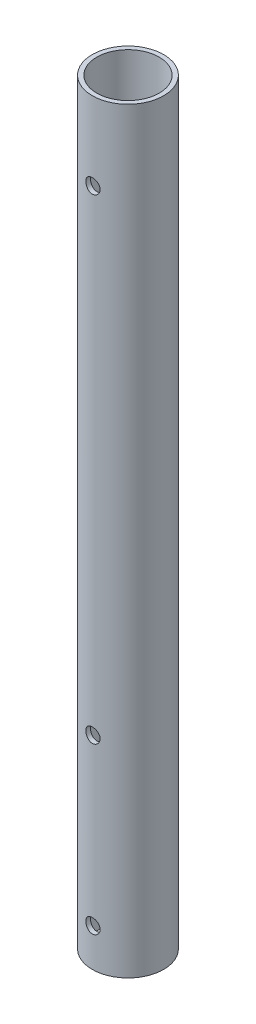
ISO-10303-21;
HEADER;
FILE_DESCRIPTION(('STEP AP214'),'2;1');
FILE_NAME('part.step','',(''),(''),'','','');
FILE_SCHEMA(('AUTOMOTIVE_DESIGN { 1 0 10303 214 1 1 1 1 }'));
ENDSEC;
DATA;
#1=APPLICATION_CONTEXT('core data for automotive mechanical design processes');
#2=APPLICATION_PROTOCOL_DEFINITION('international standard','automotive_design',2000,#1);
#3=PRODUCT_CONTEXT('',#1,'mechanical');
#4=PRODUCT('Part','Part','',(#3));
#5=PRODUCT_RELATED_PRODUCT_CATEGORY('part','',(#4));
#6=PRODUCT_DEFINITION_FORMATION('','',#4);
#7=PRODUCT_DEFINITION_CONTEXT('part definition',#1,'design');
#8=PRODUCT_DEFINITION('design','',#6,#7);
#9=PRODUCT_DEFINITION_SHAPE('','',#8);
#10=(LENGTH_UNIT() NAMED_UNIT(*) SI_UNIT(.MILLI.,.METRE.));
#11=(NAMED_UNIT(*) PLANE_ANGLE_UNIT() SI_UNIT($,.RADIAN.));
#12=(NAMED_UNIT(*) SI_UNIT($,.STERADIAN.) SOLID_ANGLE_UNIT());
#13=UNCERTAINTY_MEASURE_WITH_UNIT(LENGTH_MEASURE(1.E-05),#10,'distance_accuracy_value','');
#14=(GEOMETRIC_REPRESENTATION_CONTEXT(3) GLOBAL_UNCERTAINTY_ASSIGNED_CONTEXT((#13)) GLOBAL_UNIT_ASSIGNED_CONTEXT((#10,
#11,#12)) REPRESENTATION_CONTEXT('',''));
#15=CARTESIAN_POINT('',(0.,0.,0.));
#16=DIRECTION('',(0.,0.,1.));
#17=DIRECTION('',(1.,0.,0.));
#18=AXIS2_PLACEMENT_3D('',#15,#16,#17);
#19=CARTESIAN_POINT('',(0.,169.65,0.));
#20=DIRECTION('',(0.,1.,0.));
#21=DIRECTION('',(0.,0.,1.));
#22=AXIS2_PLACEMENT_3D('',#19,#20,#21);
#23=PLANE('',#22);
#24=CARTESIAN_POINT('',(0.,169.65,0.));
#25=DIRECTION('',(0.,1.,0.));
#26=DIRECTION('',(0.,0.,1.));
#27=AXIS2_PLACEMENT_3D('',#24,#25,#26);
#28=CIRCLE('',#27,8.);
#29=CARTESIAN_POINT('',(0.,169.65,8.));
#30=VERTEX_POINT('',#29);
#31=EDGE_CURVE('E10',#30,#30,#28,.T.);
#32=ORIENTED_EDGE('',*,*,#31,.T.);
#33=EDGE_LOOP('',(#32));
#34=FACE_BOUND('',#33,.T.);
#35=CARTESIAN_POINT('',(0.,169.65,0.));
#36=DIRECTION('',(0.,1.,0.));
#37=DIRECTION('',(0.,0.,1.));
#38=AXIS2_PLACEMENT_3D('',#35,#36,#37);
#39=CIRCLE('',#38,7.);
#40=CARTESIAN_POINT('',(0.,169.65,7.));
#41=VERTEX_POINT('',#40);
#42=EDGE_CURVE('E60',#41,#41,#39,.T.);
#43=ORIENTED_EDGE('',*,*,#42,.F.);
#44=EDGE_LOOP('',(#43));
#45=FACE_BOUND('',#44,.T.);
#46=ADVANCED_FACE('F41',(#34,#45),#23,.T.);
#47=CARTESIAN_POINT('',(0.,0.,0.));
#48=DIRECTION('',(0.,1.,0.));
#49=DIRECTION('',(0.,0.,1.));
#50=AXIS2_PLACEMENT_3D('',#47,#48,#49);
#51=PLANE('',#50);
#52=CARTESIAN_POINT('',(0.,0.,0.));
#53=DIRECTION('',(0.,1.,0.));
#54=DIRECTION('',(0.,0.,1.));
#55=AXIS2_PLACEMENT_3D('',#52,#53,#54);
#56=CIRCLE('',#55,8.);
#57=CARTESIAN_POINT('',(0.,0.,8.));
#58=VERTEX_POINT('',#57);
#59=EDGE_CURVE('E55',#58,#58,#56,.T.);
#60=ORIENTED_EDGE('',*,*,#59,.F.);
#61=EDGE_LOOP('',(#60));
#62=FACE_BOUND('',#61,.T.);
#63=CARTESIAN_POINT('',(0.,0.,0.));
#64=DIRECTION('',(0.,1.,0.));
#65=DIRECTION('',(0.,0.,1.));
#66=AXIS2_PLACEMENT_3D('',#63,#64,#65);
#67=CIRCLE('',#66,7.);
#68=CARTESIAN_POINT('',(0.,0.,7.));
#69=VERTEX_POINT('',#68);
#70=EDGE_CURVE('E63',#69,#69,#67,.T.);
#71=ORIENTED_EDGE('',*,*,#70,.T.);
#72=EDGE_LOOP('',(#71));
#73=FACE_BOUND('',#72,.T.);
#74=ADVANCED_FACE('F176',(#62,#73),#51,.F.);
#75=CARTESIAN_POINT('',(0.,169.65,0.));
#76=DIRECTION('',(0.,-1.,0.));
#77=DIRECTION('',(0.,0.,-1.));
#78=AXIS2_PLACEMENT_3D('',#75,#76,#77);
#79=CYLINDRICAL_SURFACE('',#78,8.);
#80=CARTESIAN_POINT('',(0.,153.75,-8.));
#81=CARTESIAN_POINT('',(-0.0889230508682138,153.749996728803,-7.99999836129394));
#82=CARTESIAN_POINT('',(-0.177887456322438,153.742561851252,-7.9985021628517));
#83=CARTESIAN_POINT('',(-0.353301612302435,153.713042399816,-7.9926778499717));
#84=CARTESIAN_POINT('',(-0.439749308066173,153.690946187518,-7.98834748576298));
#85=CARTESIAN_POINT('',(-0.607568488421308,153.632813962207,-7.97733838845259));
#86=CARTESIAN_POINT('',(-0.688944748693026,153.596791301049,-7.97066190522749));
#87=CARTESIAN_POINT('',(-0.844492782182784,153.511868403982,-7.95568636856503));
#88=CARTESIAN_POINT('',(-0.918664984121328,153.462968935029,-7.94738741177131));
#89=CARTESIAN_POINT('',(-1.05870956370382,153.352978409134,-7.92995464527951));
#90=CARTESIAN_POINT('',(-1.12447032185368,153.291746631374,-7.92081192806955));
#91=CARTESIAN_POINT('',(-1.2448588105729,153.159132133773,-7.90278688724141));
#92=CARTESIAN_POINT('',(-1.29948567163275,153.087748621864,-7.89390458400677));
#93=CARTESIAN_POINT('',(-1.39653080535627,152.936054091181,-7.87731906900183));
#94=CARTESIAN_POINT('',(-1.43883350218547,152.855667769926,-7.86962731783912));
#95=CARTESIAN_POINT('',(-1.50928906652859,152.688749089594,-7.85642028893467));
#96=CARTESIAN_POINT('',(-1.53744333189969,152.602217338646,-7.85090479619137));
#97=CARTESIAN_POINT('',(-1.57844047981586,152.426665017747,-7.84276488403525));
#98=CARTESIAN_POINT('',(-1.59147919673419,152.337691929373,-7.84010352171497));
#99=CARTESIAN_POINT('',(-1.60248340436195,152.158784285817,-7.83786200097));
#100=CARTESIAN_POINT('',(-1.60045043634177,152.068849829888,-7.83828152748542));
#101=CARTESIAN_POINT('',(-1.5815273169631,151.892005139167,-7.84212081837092));
#102=CARTESIAN_POINT('',(-1.56486166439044,151.805069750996,-7.84549524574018));
#103=CARTESIAN_POINT('',(-1.51750061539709,151.635254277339,-7.85479273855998));
#104=CARTESIAN_POINT('',(-1.48680454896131,151.55237438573,-7.86071592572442));
#105=CARTESIAN_POINT('',(-1.41203965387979,151.392375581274,-7.87448989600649));
#106=CARTESIAN_POINT('',(-1.36788184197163,151.315299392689,-7.88235343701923));
#107=CARTESIAN_POINT('',(-1.26750971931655,151.169566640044,-7.89911390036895));
#108=CARTESIAN_POINT('',(-1.2112940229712,151.100911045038,-7.90801094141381));
#109=CARTESIAN_POINT('',(-1.08719989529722,150.972672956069,-7.92603233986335));
#110=CARTESIAN_POINT('',(-1.0191298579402,150.913275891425,-7.93515790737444));
#111=CARTESIAN_POINT('',(-0.87389603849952,150.806713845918,-7.9524615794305));
#112=CARTESIAN_POINT('',(-0.796732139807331,150.75954902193,-7.96063967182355));
#113=CARTESIAN_POINT('',(-0.635295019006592,150.678755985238,-7.97514704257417));
#114=CARTESIAN_POINT('',(-0.551010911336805,150.645148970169,-7.98147342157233));
#115=CARTESIAN_POINT('',(-0.377838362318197,150.592623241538,-7.99154254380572));
#116=CARTESIAN_POINT('',(-0.288950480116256,150.573702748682,-7.99528560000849));
#117=CARTESIAN_POINT('',(-0.110687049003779,150.551349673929,-7.99972274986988));
#118=CARTESIAN_POINT('',(-0.0213445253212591,150.547663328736,-8.00046679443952));
#119=CARTESIAN_POINT('',(0.156679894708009,150.555199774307,-7.99896083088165));
#120=CARTESIAN_POINT('',(0.245361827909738,150.566421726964,-7.99671099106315));
#121=CARTESIAN_POINT('',(0.418729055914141,150.60324539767,-7.9895013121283));
#122=CARTESIAN_POINT('',(0.503443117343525,150.628716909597,-7.98456602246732));
#123=CARTESIAN_POINT('',(0.667397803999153,150.693174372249,-7.97253683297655));
#124=CARTESIAN_POINT('',(0.746638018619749,150.732161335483,-7.96544277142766));
#125=CARTESIAN_POINT('',(0.898465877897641,150.823091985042,-7.94975858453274));
#126=CARTESIAN_POINT('',(0.9709602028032,150.875188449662,-7.94115120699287));
#127=CARTESIAN_POINT('',(1.10626883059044,150.990654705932,-7.92343575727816));
#128=CARTESIAN_POINT('',(1.16908209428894,151.05402570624,-7.91432763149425));
#129=CARTESIAN_POINT('',(1.28422494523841,151.191397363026,-7.89646885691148));
#130=CARTESIAN_POINT('',(1.33638032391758,151.265545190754,-7.88772576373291));
#131=CARTESIAN_POINT('',(1.42749667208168,151.421698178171,-7.87174706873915));
#132=CARTESIAN_POINT('',(1.46645816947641,151.503703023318,-7.86451140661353));
#133=CARTESIAN_POINT('',(1.52984294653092,151.672829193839,-7.85242784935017));
#134=CARTESIAN_POINT('',(1.55434159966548,151.759921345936,-7.84756759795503));
#135=CARTESIAN_POINT('',(1.58833384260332,151.937093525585,-7.84075898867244));
#136=CARTESIAN_POINT('',(1.59782938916,152.027173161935,-7.83881025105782));
#137=CARTESIAN_POINT('',(1.60147345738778,152.206014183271,-7.8380663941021));
#138=CARTESIAN_POINT('',(1.59589726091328,152.294769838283,-7.83921470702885));
#139=CARTESIAN_POINT('',(1.57016368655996,152.470050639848,-7.84440917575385));
#140=CARTESIAN_POINT('',(1.55000642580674,152.556575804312,-7.84845530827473));
#141=CARTESIAN_POINT('',(1.49580570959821,152.724764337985,-7.85896422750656));
#142=CARTESIAN_POINT('',(1.46179601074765,152.806438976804,-7.86542113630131));
#143=CARTESIAN_POINT('',(1.38088743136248,152.962965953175,-7.88002743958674));
#144=CARTESIAN_POINT('',(1.33398747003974,153.03781771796,-7.88817697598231));
#145=CARTESIAN_POINT('',(1.22768946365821,153.17994491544,-7.90542336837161));
#146=CARTESIAN_POINT('',(1.16809261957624,153.247070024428,-7.9145339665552));
#147=CARTESIAN_POINT('',(1.03850299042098,153.370457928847,-7.93257730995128));
#148=CARTESIAN_POINT('',(0.968507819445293,153.426718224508,-7.94151001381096));
#149=CARTESIAN_POINT('',(0.819228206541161,153.527335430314,-7.95830131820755));
#150=CARTESIAN_POINT('',(0.739854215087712,153.571561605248,-7.96614769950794));
#151=CARTESIAN_POINT('',(0.574666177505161,153.645977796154,-7.97976200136));
#152=CARTESIAN_POINT('',(0.488858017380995,153.676180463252,-7.98553179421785));
#153=CARTESIAN_POINT('',(0.335714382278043,153.715843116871,-7.99322196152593));
#154=CARTESIAN_POINT('',(0.269250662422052,153.728629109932,-7.99574885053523));
#155=CARTESIAN_POINT('',(0.135199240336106,153.745708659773,-7.99913846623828));
#156=CARTESIAN_POINT('',(0.0676115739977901,153.750002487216,-8.00000124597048));
#157=CARTESIAN_POINT('',(0.,153.75,-8.));
#158=B_SPLINE_CURVE_WITH_KNOTS('',3,(#80,#81,#82,#83,#84,#85,#86,#87,#88,#89,#90,#91,#92,#93,
#94,#95,#96,#97,#98,#99,#100,#101,#102,#103,#104,#105,#106,#107,#108,#109,#110,#111,#112,#113,
#114,#115,#116,#117,#118,#119,#120,#121,#122,#123,#124,#125,#126,#127,#128,#129,#130,#131,#132,
#133,#134,#135,#136,#137,#138,#139,#140,#141,#142,#143,#144,#145,#146,#147,#148,#149,#150,#151,
#152,#153,#154,#155,#156,#157),.UNSPECIFIED.,.T.,.F.,(4,2,2,2,2,2,2,2,2,2,2,2,2,2,2,2,2,2,2,2,2,
2,2,2,2,2,2,2,2,2,2,2,2,2,2,2,2,2,4),(0.,0.266521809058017,0.533255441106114,0.799733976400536,
1.06619664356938,1.33589227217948,1.60560895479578,1.87777912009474,2.14992238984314,
2.4184989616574,2.68704806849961,2.95154763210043,3.21605982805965,3.48235984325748,
3.74869047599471,4.01981203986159,4.29093708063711,4.56248439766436,4.83399881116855,
5.10097177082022,5.36792972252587,5.63248726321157,5.89706462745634,6.16488105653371,
6.43272621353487,6.7046500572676,6.97656301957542,7.24704609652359,7.51749389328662,
7.7830355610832,8.04857509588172,8.31347138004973,8.5783898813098,8.84780921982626,
9.11729047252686,9.38959194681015,9.66164728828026,9.86430040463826,10.0669470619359),.UNSPECIFIED.);
#159=CARTESIAN_POINT('',(0.,153.75,-8.));
#160=VERTEX_POINT('',#159);
#161=EDGE_CURVE('E127',#160,#160,#158,.T.);
#162=ORIENTED_EDGE('',*,*,#161,.T.);
#163=EDGE_LOOP('',(#162));
#164=FACE_BOUND('',#163,.T.);
#165=CARTESIAN_POINT('',(1.59999999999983,152.15,7.83836717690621));
#166=CARTESIAN_POINT('',(1.59999671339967,152.061096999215,7.8383689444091));
#167=CARTESIAN_POINT('',(1.5925650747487,151.972152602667,7.83989613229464));
#168=CARTESIAN_POINT('',(1.56305965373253,151.796779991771,7.84583090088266));
#169=CARTESIAN_POINT('',(1.54097415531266,151.710353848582,7.85024078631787));
#170=CARTESIAN_POINT('',(1.48287325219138,151.542580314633,7.86142197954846));
#171=CARTESIAN_POINT('',(1.44687170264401,151.461227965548,7.8681909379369));
#172=CARTESIAN_POINT('',(1.36199857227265,151.305720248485,7.8833247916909));
#173=CARTESIAN_POINT('',(1.31312770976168,151.231564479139,7.89168959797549));
#174=CARTESIAN_POINT('',(1.20316652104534,151.091502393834,7.90920479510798));
#175=CARTESIAN_POINT('',(1.14192904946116,151.025712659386,7.91836380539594));
#176=CARTESIAN_POINT('',(1.00929086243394,150.905267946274,7.93635955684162));
#177=CARTESIAN_POINT('',(0.937889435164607,150.850613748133,7.94519627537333));
#178=CARTESIAN_POINT('',(0.786178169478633,150.753539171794,7.961644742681));
#179=CARTESIAN_POINT('',(0.705796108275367,150.711229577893,7.96924514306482));
#180=CARTESIAN_POINT('',(0.538886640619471,150.640760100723,7.98226779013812));
#181=CARTESIAN_POINT('',(0.452359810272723,150.612598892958,7.98769024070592));
#182=CARTESIAN_POINT('',(0.276826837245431,150.571588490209,7.9956851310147));
#183=CARTESIAN_POINT('',(0.187868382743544,150.558542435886,7.99829418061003));
#184=CARTESIAN_POINT('',(0.00898970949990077,150.547518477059,8.00049473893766));
#185=CARTESIAN_POINT('',(-0.0809304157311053,150.549539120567,8.00008653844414));
#186=CARTESIAN_POINT('',(-0.257827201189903,150.568441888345,7.99632695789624));
#187=CARTESIAN_POINT('',(-0.344827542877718,150.585111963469,7.99301757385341));
#188=CARTESIAN_POINT('',(-0.514770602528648,150.632504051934,7.98387483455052));
#189=CARTESIAN_POINT('',(-0.597713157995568,150.663226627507,7.97804137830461));
#190=CARTESIAN_POINT('',(-0.757791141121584,150.738048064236,7.96443673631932));
#191=CARTESIAN_POINT('',(-0.834886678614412,150.782230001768,7.95665357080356));
#192=CARTESIAN_POINT('',(-0.980648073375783,150.882654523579,7.94000751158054));
#193=CARTESIAN_POINT('',(-1.04931295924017,150.938898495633,7.93114449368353));
#194=CARTESIAN_POINT('',(-1.17752228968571,151.063013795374,7.91313542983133));
#195=CARTESIAN_POINT('',(-1.23688690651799,151.131070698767,7.90398714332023));
#196=CARTESIAN_POINT('',(-1.34338958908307,151.276266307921,7.88658514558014));
#197=CARTESIAN_POINT('',(-1.39052742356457,151.353405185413,7.87833145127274));
#198=CARTESIAN_POINT('',(-1.47130050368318,151.514833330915,7.86364875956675));
#199=CARTESIAN_POINT('',(-1.5049066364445,151.599137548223,7.85722370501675));
#200=CARTESIAN_POINT('',(-1.5574245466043,151.772354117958,7.84698362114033));
#201=CARTESIAN_POINT('',(-1.57633823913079,151.861265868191,7.84316825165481));
#202=CARTESIAN_POINT('',(-1.59866560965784,152.039543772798,7.83864766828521));
#203=CARTESIAN_POINT('',(-1.60233897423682,152.128876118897,7.83789035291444));
#204=CARTESIAN_POINT('',(-1.59478020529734,152.306877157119,7.83943177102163));
#205=CARTESIAN_POINT('',(-1.58354891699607,152.39554588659,7.84173033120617));
#206=CARTESIAN_POINT('',(-1.54672353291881,152.568829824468,7.8490757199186));
#207=CARTESIAN_POINT('',(-1.52126819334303,152.653475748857,7.85409598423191));
#208=CARTESIAN_POINT('',(-1.45686565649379,152.817301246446,7.86629582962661));
#209=CARTESIAN_POINT('',(-1.41791734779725,152.896480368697,7.87347558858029));
#210=CARTESIAN_POINT('',(-1.32704662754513,153.04826097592,7.8893024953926));
#211=CARTESIAN_POINT('',(-1.27496172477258,153.120763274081,7.89796754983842));
#212=CARTESIAN_POINT('',(-1.15951291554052,153.256093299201,7.91573958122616));
#213=CARTESIAN_POINT('',(-1.09614784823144,153.318920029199,7.92484660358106));
#214=CARTESIAN_POINT('',(-0.958771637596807,153.434100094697,7.94264553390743));
#215=CARTESIAN_POINT('',(-0.884611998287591,153.48627784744,7.95132892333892));
#216=CARTESIAN_POINT('',(-0.728428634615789,153.577433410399,7.9671540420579));
#217=CARTESIAN_POINT('',(-0.646405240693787,153.616411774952,7.97429583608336));
#218=CARTESIAN_POINT('',(-0.477284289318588,153.679806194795,7.98619670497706));
#219=CARTESIAN_POINT('',(-0.390218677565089,153.704304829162,7.99096926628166));
#220=CARTESIAN_POINT('',(-0.213103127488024,153.738305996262,7.99765177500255));
#221=CARTESIAN_POINT('',(-0.12305354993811,153.747810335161,7.99956206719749));
#222=CARTESIAN_POINT('',(0.0557966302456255,153.751483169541,8.00029664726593));
#223=CARTESIAN_POINT('',(0.144591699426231,153.74591564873,7.99917405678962));
#224=CARTESIAN_POINT('',(0.319953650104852,153.720185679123,7.99408069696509));
#225=CARTESIAN_POINT('',(0.406520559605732,153.700023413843,7.99010996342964));
#226=CARTESIAN_POINT('',(0.574804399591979,153.645793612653,7.97976797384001));
#227=CARTESIAN_POINT('',(0.656531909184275,153.61175779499,7.97340219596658));
#228=CARTESIAN_POINT('',(0.813153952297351,153.530780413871,7.95895555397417));
#229=CARTESIAN_POINT('',(0.888047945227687,153.483837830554,7.95087455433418));
#230=CARTESIAN_POINT('',(1.03018222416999,153.377488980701,7.93372158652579));
#231=CARTESIAN_POINT('',(1.09727954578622,153.317893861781,7.92463573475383));
#232=CARTESIAN_POINT('',(1.22061218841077,153.188319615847,7.90657956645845));
#233=CARTESIAN_POINT('',(1.27684493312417,153.11833803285,7.89760927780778));
#234=CARTESIAN_POINT('',(1.37742755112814,152.96907309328,7.88069348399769));
#235=CARTESIAN_POINT('',(1.42164290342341,152.889697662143,7.87276005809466));
#236=CARTESIAN_POINT('',(1.49603847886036,152.724507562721,7.85896379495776));
#237=CARTESIAN_POINT('',(1.52623143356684,152.638698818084,7.85309908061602));
#238=CARTESIAN_POINT('',(1.56587062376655,152.485580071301,7.84527489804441));
#239=CARTESIAN_POINT('',(1.57864623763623,152.41914332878,7.84270055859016));
#240=CARTESIAN_POINT('',(1.59571202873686,152.285145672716,7.83924605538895));
#241=CARTESIAN_POINT('',(1.60000249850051,152.217584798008,7.83836583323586));
#242=CARTESIAN_POINT('',(1.59999999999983,152.15,7.83836717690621));
#243=B_SPLINE_CURVE_WITH_KNOTS('',3,(#165,#166,#167,#168,#169,#170,#171,#172,#173,#174,#175,
#176,#177,#178,#179,#180,#181,#182,#183,#184,#185,#186,#187,#188,#189,#190,#191,#192,#193,#194,
#195,#196,#197,#198,#199,#200,#201,#202,#203,#204,#205,#206,#207,#208,#209,#210,#211,#212,#213,
#214,#215,#216,#217,#218,#219,#220,#221,#222,#223,#224,#225,#226,#227,#228,#229,#230,#231,#232,
#233,#234,#235,#236,#237,#238,#239,#240,#241,#242),.UNSPECIFIED.,.T.,.F.,(4,2,2,2,2,2,2,2,2,2,2,
2,2,2,2,2,2,2,2,2,2,2,2,2,2,2,2,2,2,2,2,2,2,2,2,2,2,2,4),(0.,0.266461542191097,
0.533136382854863,0.799546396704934,1.06594154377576,1.33571604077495,1.60550944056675,
1.8776544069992,2.14977389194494,2.41830798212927,2.68681619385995,2.95150063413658,
3.21619566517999,3.48255878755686,3.74895257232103,4.01998954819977,4.29103164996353,
4.56265381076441,4.83424056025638,5.10118012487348,5.36810455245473,5.63246946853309,
5.89685616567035,6.16468895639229,6.43254932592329,6.70452162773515,6.97648250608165,
7.24687701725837,7.51723895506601,7.78289627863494,8.04855026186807,8.3136002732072,
8.5786712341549,8.84801843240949,9.11742942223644,9.38974237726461,9.66180760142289,
9.8643808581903,10.0669471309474),.UNSPECIFIED.);
#244=CARTESIAN_POINT('',(1.59999999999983,152.15,7.83836717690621));
#245=VERTEX_POINT('',#244);
#246=EDGE_CURVE('E121',#245,#245,#243,.T.);
#247=ORIENTED_EDGE('',*,*,#246,.T.);
#248=EDGE_LOOP('',(#247));
#249=FACE_BOUND('',#248,.T.);
#250=CARTESIAN_POINT('',(0.,47.1000000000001,-8.));
#251=CARTESIAN_POINT('',(-0.0889230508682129,47.0999967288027,-7.99999836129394));
#252=CARTESIAN_POINT('',(-0.177887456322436,47.0925618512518,-7.9985021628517));
#253=CARTESIAN_POINT('',(-0.353301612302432,47.0630423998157,-7.9926778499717));
#254=CARTESIAN_POINT('',(-0.439749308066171,47.0409461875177,-7.98834748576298));
#255=CARTESIAN_POINT('',(-0.607568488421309,46.9828139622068,-7.97733838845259));
#256=CARTESIAN_POINT('',(-0.688944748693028,46.9467913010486,-7.97066190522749));
#257=CARTESIAN_POINT('',(-0.844492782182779,46.861868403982,-7.95568636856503));
#258=CARTESIAN_POINT('',(-0.918664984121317,46.8129689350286,-7.94738741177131));
#259=CARTESIAN_POINT('',(-1.05870956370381,46.7029784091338,-7.92995464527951));
#260=CARTESIAN_POINT('',(-1.12447032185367,46.6417466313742,-7.92081192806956));
#261=CARTESIAN_POINT('',(-1.24485881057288,46.5091321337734,-7.90278688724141));
#262=CARTESIAN_POINT('',(-1.29948567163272,46.437748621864,-7.89390458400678));
#263=CARTESIAN_POINT('',(-1.39653080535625,46.2860540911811,-7.87731906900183));
#264=CARTESIAN_POINT('',(-1.43883350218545,46.205667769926,-7.86962731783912));
#265=CARTESIAN_POINT('',(-1.50928906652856,46.0387490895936,-7.85642028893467));
#266=CARTESIAN_POINT('',(-1.53744333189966,45.952217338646,-7.85090479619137));
#267=CARTESIAN_POINT('',(-1.57844047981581,45.7766650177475,-7.84276488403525));
#268=CARTESIAN_POINT('',(-1.59147919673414,45.6876919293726,-7.84010352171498));
#269=CARTESIAN_POINT('',(-1.6024834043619,45.5087842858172,-7.83786200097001));
#270=CARTESIAN_POINT('',(-1.60045043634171,45.4188498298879,-7.83828152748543));
#271=CARTESIAN_POINT('',(-1.58152731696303,45.2420051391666,-7.84212081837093));
#272=CARTESIAN_POINT('',(-1.56486166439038,45.1550697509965,-7.84549524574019));
#273=CARTESIAN_POINT('',(-1.51750061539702,44.9852542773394,-7.85479273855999));
#274=CARTESIAN_POINT('',(-1.48680454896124,44.9023743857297,-7.86071592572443));
#275=CARTESIAN_POINT('',(-1.41203965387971,44.7423755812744,-7.8744898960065));
#276=CARTESIAN_POINT('',(-1.36788184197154,44.6652993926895,-7.88235343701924));
#277=CARTESIAN_POINT('',(-1.26750971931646,44.5195666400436,-7.89911390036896));
#278=CARTESIAN_POINT('',(-1.2112940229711,44.4509110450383,-7.90801094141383));
#279=CARTESIAN_POINT('',(-1.08719989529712,44.322672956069,-7.92603233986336));
#280=CARTESIAN_POINT('',(-1.0191298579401,44.2632758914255,-7.93515790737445));
#281=CARTESIAN_POINT('',(-0.873896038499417,44.1567138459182,-7.95246157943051));
#282=CARTESIAN_POINT('',(-0.796732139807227,44.1095490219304,-7.96063967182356));
#283=CARTESIAN_POINT('',(-0.635295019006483,44.0287559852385,-7.97514704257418));
#284=CARTESIAN_POINT('',(-0.551010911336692,43.9951489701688,-7.98147342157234));
#285=CARTESIAN_POINT('',(-0.37783836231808,43.9426232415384,-7.99154254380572));
#286=CARTESIAN_POINT('',(-0.288950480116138,43.9237027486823,-7.99528560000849));
#287=CARTESIAN_POINT('',(-0.11068704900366,43.9013496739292,-7.99972274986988));
#288=CARTESIAN_POINT('',(-0.0213445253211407,43.8976633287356,-8.00046679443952));
#289=CARTESIAN_POINT('',(0.156679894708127,43.9051997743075,-7.99896083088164));
#290=CARTESIAN_POINT('',(0.245361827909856,43.9164217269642,-7.99671099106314));
#291=CARTESIAN_POINT('',(0.418729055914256,43.9532453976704,-7.98950131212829));
#292=CARTESIAN_POINT('',(0.503443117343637,43.9787169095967,-7.98456602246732));
#293=CARTESIAN_POINT('',(0.667397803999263,44.0431743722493,-7.97253683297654));
#294=CARTESIAN_POINT('',(0.746638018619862,44.0821613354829,-7.96544277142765));
#295=CARTESIAN_POINT('',(0.898465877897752,44.1730919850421,-7.94975858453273));
#296=CARTESIAN_POINT('',(0.970960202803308,44.2251884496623,-7.94115120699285));
#297=CARTESIAN_POINT('',(1.10626883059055,44.3406547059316,-7.92343575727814));
#298=CARTESIAN_POINT('',(1.16908209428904,44.4040257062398,-7.91432763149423));
#299=CARTESIAN_POINT('',(1.28422494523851,44.5413973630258,-7.89646885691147));
#300=CARTESIAN_POINT('',(1.33638032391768,44.6155451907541,-7.88772576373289));
#301=CARTESIAN_POINT('',(1.42749667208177,44.7716981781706,-7.87174706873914));
#302=CARTESIAN_POINT('',(1.46645816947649,44.8537030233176,-7.86451140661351));
#303=CARTESIAN_POINT('',(1.52984294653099,45.0228291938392,-7.85242784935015));
#304=CARTESIAN_POINT('',(1.55434159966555,45.1099213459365,-7.84756759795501));
#305=CARTESIAN_POINT('',(1.58833384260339,45.2870935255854,-7.84075898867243));
#306=CARTESIAN_POINT('',(1.59782938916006,45.3771731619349,-7.83881025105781));
#307=CARTESIAN_POINT('',(1.60147345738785,45.5560141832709,-7.83806639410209));
#308=CARTESIAN_POINT('',(1.59589726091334,45.6447698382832,-7.83921470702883));
#309=CARTESIAN_POINT('',(1.57016368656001,45.820050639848,-7.84440917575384));
#310=CARTESIAN_POINT('',(1.5500064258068,45.9065758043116,-7.84845530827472));
#311=CARTESIAN_POINT('',(1.49580570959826,46.0747643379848,-7.85896422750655));
#312=CARTESIAN_POINT('',(1.46179601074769,46.1564389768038,-7.8654211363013));
#313=CARTESIAN_POINT('',(1.38088743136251,46.3129659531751,-7.88002743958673));
#314=CARTESIAN_POINT('',(1.33398747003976,46.3878177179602,-7.88817697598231));
#315=CARTESIAN_POINT('',(1.22768946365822,46.5299449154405,-7.90542336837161));
#316=CARTESIAN_POINT('',(1.16809261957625,46.5970700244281,-7.9145339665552));
#317=CARTESIAN_POINT('',(1.038502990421,46.7204579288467,-7.93257730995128));
#318=CARTESIAN_POINT('',(0.968507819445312,46.7767182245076,-7.94151001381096));
#319=CARTESIAN_POINT('',(0.819228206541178,46.8773354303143,-7.95830131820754));
#320=CARTESIAN_POINT('',(0.739854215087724,46.921561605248,-7.96614769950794));
#321=CARTESIAN_POINT('',(0.574666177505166,46.9959777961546,-7.97976200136));
#322=CARTESIAN_POINT('',(0.488858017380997,47.026180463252,-7.98553179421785));
#323=CARTESIAN_POINT('',(0.335714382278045,47.0658431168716,-7.99322196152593));
#324=CARTESIAN_POINT('',(0.269250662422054,47.0786291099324,-7.99574885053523));
#325=CARTESIAN_POINT('',(0.135199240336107,47.0957086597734,-7.99913846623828));
#326=CARTESIAN_POINT('',(0.0676115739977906,47.1000024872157,-8.00000124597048));
#327=CARTESIAN_POINT('',(0.,47.1000000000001,-8.));
#328=B_SPLINE_CURVE_WITH_KNOTS('',3,(#250,#251,#252,#253,#254,#255,#256,#257,#258,#259,#260,
#261,#262,#263,#264,#265,#266,#267,#268,#269,#270,#271,#272,#273,#274,#275,#276,#277,#278,#279,
#280,#281,#282,#283,#284,#285,#286,#287,#288,#289,#290,#291,#292,#293,#294,#295,#296,#297,#298,
#299,#300,#301,#302,#303,#304,#305,#306,#307,#308,#309,#310,#311,#312,#313,#314,#315,#316,#317,
#318,#319,#320,#321,#322,#323,#324,#325,#326,#327),.UNSPECIFIED.,.T.,.F.,(4,2,2,2,2,2,2,2,2,2,2,
2,2,2,2,2,2,2,2,2,2,2,2,2,2,2,2,2,2,2,2,2,2,2,2,2,2,2,4),(0.,0.266521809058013,
0.533255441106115,0.799733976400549,1.06619664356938,1.33589227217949,1.60560895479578,
1.87777912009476,2.14992238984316,2.4184989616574,2.6870480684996,2.95154763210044,
3.21605982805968,3.48235984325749,3.74869047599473,4.0198120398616,4.29093708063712,
4.56248439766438,4.83399881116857,5.10097177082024,5.36792972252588,5.63248726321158,
5.89706462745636,6.16488105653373,6.43272621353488,6.70465005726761,6.97656301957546,
7.24704609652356,7.51749389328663,7.78303556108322,8.04857509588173,8.31347138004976,
8.57838988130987,8.84780921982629,9.11729047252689,9.38959194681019,9.6616472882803,
9.8643004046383,10.0669470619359),.UNSPECIFIED.);
#329=CARTESIAN_POINT('',(0.,47.1000000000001,-8.));
#330=VERTEX_POINT('',#329);
#331=EDGE_CURVE('E113',#330,#330,#328,.T.);
#332=ORIENTED_EDGE('',*,*,#331,.T.);
#333=EDGE_LOOP('',(#332));
#334=FACE_BOUND('',#333,.T.);
#335=CARTESIAN_POINT('',(1.59999999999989,45.5000000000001,7.8383671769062));
#336=CARTESIAN_POINT('',(1.59999671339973,45.4110969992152,7.83836894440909));
#337=CARTESIAN_POINT('',(1.59256507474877,45.322152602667,7.83989613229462));
#338=CARTESIAN_POINT('',(1.5630596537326,45.1467799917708,7.84583090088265));
#339=CARTESIAN_POINT('',(1.54097415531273,45.0603538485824,7.85024078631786));
#340=CARTESIAN_POINT('',(1.48287325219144,44.8925803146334,7.86142197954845));
#341=CARTESIAN_POINT('',(1.44687170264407,44.8112279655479,7.86819093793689));
#342=CARTESIAN_POINT('',(1.36199857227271,44.6557202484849,7.88332479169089));
#343=CARTESIAN_POINT('',(1.31312770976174,44.5815644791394,7.89168959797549));
#344=CARTESIAN_POINT('',(1.20316652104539,44.4415023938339,7.90920479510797));
#345=CARTESIAN_POINT('',(1.1419290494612,44.3757126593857,7.91836380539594));
#346=CARTESIAN_POINT('',(1.00929086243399,44.2552679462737,7.93635955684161));
#347=CARTESIAN_POINT('',(0.937889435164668,44.2006137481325,7.94519627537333));
#348=CARTESIAN_POINT('',(0.786178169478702,44.1035391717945,7.961644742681));
#349=CARTESIAN_POINT('',(0.705796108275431,44.0612295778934,7.96924514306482));
#350=CARTESIAN_POINT('',(0.538886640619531,43.990760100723,7.98226779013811));
#351=CARTESIAN_POINT('',(0.452359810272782,43.9625988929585,7.98769024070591));
#352=CARTESIAN_POINT('',(0.276826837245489,43.9215884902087,7.9956851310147));
#353=CARTESIAN_POINT('',(0.187868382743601,43.9085424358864,7.99829418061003));
#354=CARTESIAN_POINT('',(0.00898970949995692,43.8975184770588,8.00049473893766));
#355=CARTESIAN_POINT('',(-0.0809304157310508,43.8995391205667,8.00008653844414));
#356=CARTESIAN_POINT('',(-0.257827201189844,43.918441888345,7.99632695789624));
#357=CARTESIAN_POINT('',(-0.344827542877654,43.9351119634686,7.99301757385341));
#358=CARTESIAN_POINT('',(-0.514770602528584,43.9825040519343,7.98387483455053));
#359=CARTESIAN_POINT('',(-0.597713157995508,44.0132266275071,7.97804137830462));
#360=CARTESIAN_POINT('',(-0.757791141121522,44.0880480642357,7.96443673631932));
#361=CARTESIAN_POINT('',(-0.834886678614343,44.1322300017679,7.95665357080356));
#362=CARTESIAN_POINT('',(-0.980648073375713,44.2326545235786,7.94000751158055));
#363=CARTESIAN_POINT('',(-1.04931295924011,44.2888984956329,7.93114449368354));
#364=CARTESIAN_POINT('',(-1.17752228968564,44.4130137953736,7.91313542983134));
#365=CARTESIAN_POINT('',(-1.23688690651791,44.4810706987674,7.90398714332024));
#366=CARTESIAN_POINT('',(-1.343389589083,44.6262663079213,7.88658514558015));
#367=CARTESIAN_POINT('',(-1.3905274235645,44.7034051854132,7.87833145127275));
#368=CARTESIAN_POINT('',(-1.47130050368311,44.8648333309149,7.86364875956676));
#369=CARTESIAN_POINT('',(-1.50490663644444,44.9491375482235,7.85722370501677));
#370=CARTESIAN_POINT('',(-1.55742454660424,45.1223541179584,7.84698362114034));
#371=CARTESIAN_POINT('',(-1.57633823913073,45.2112658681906,7.84316825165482));
#372=CARTESIAN_POINT('',(-1.59866560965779,45.3895437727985,7.83864766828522));
#373=CARTESIAN_POINT('',(-1.60233897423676,45.4788761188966,7.83789035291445));
#374=CARTESIAN_POINT('',(-1.59478020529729,45.6568771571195,7.83943177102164));
#375=CARTESIAN_POINT('',(-1.58354891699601,45.7455458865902,7.84173033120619));
#376=CARTESIAN_POINT('',(-1.54672353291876,45.9188298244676,7.84907571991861));
#377=CARTESIAN_POINT('',(-1.52126819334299,46.0034757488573,7.85409598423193));
#378=CARTESIAN_POINT('',(-1.45686565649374,46.167301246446,7.86629582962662));
#379=CARTESIAN_POINT('',(-1.41791734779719,46.2464803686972,7.87347558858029));
#380=CARTESIAN_POINT('',(-1.32704662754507,46.3982609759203,7.88930249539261));
#381=CARTESIAN_POINT('',(-1.27496172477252,46.4707632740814,7.89796754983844));
#382=CARTESIAN_POINT('',(-1.15951291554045,46.6060932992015,7.91573958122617));
#383=CARTESIAN_POINT('',(-1.09614784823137,46.6689200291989,7.92484660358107));
#384=CARTESIAN_POINT('',(-0.958771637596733,46.784100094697,7.94264553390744));
#385=CARTESIAN_POINT('',(-0.884611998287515,46.83627784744,7.95132892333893));
#386=CARTESIAN_POINT('',(-0.728428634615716,46.9274334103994,7.96715404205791));
#387=CARTESIAN_POINT('',(-0.646405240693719,46.9664117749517,7.97429583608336));
#388=CARTESIAN_POINT('',(-0.477284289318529,47.0298061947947,7.98619670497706));
#389=CARTESIAN_POINT('',(-0.390218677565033,47.054304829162,7.99096926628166));
#390=CARTESIAN_POINT('',(-0.21310312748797,47.0883059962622,7.99765177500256));
#391=CARTESIAN_POINT('',(-0.123053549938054,47.0978103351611,7.99956206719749));
#392=CARTESIAN_POINT('',(0.0557966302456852,47.1014831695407,8.00029664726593));
#393=CARTESIAN_POINT('',(0.144591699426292,47.09591564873,7.99917405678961));
#394=CARTESIAN_POINT('',(0.319953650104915,47.0701856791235,7.99408069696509));
#395=CARTESIAN_POINT('',(0.406520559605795,47.0500234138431,7.99010996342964));
#396=CARTESIAN_POINT('',(0.574804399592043,46.9957936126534,7.97976797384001));
#397=CARTESIAN_POINT('',(0.656531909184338,46.9617577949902,7.97340219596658));
#398=CARTESIAN_POINT('',(0.813153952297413,46.8807804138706,7.95895555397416));
#399=CARTESIAN_POINT('',(0.888047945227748,46.8338378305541,7.95087455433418));
#400=CARTESIAN_POINT('',(1.03018222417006,46.7274889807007,7.93372158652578));
#401=CARTESIAN_POINT('',(1.09727954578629,46.6678938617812,7.92463573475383));
#402=CARTESIAN_POINT('',(1.22061218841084,46.5383196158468,7.90657956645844));
#403=CARTESIAN_POINT('',(1.27684493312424,46.4683380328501,7.89760927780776));
#404=CARTESIAN_POINT('',(1.3774275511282,46.3190730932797,7.88069348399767));
#405=CARTESIAN_POINT('',(1.42164290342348,46.2396976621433,7.87276005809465));
#406=CARTESIAN_POINT('',(1.49603847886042,46.0745075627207,7.85896379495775));
#407=CARTESIAN_POINT('',(1.52623143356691,45.988698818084,7.85309908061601));
#408=CARTESIAN_POINT('',(1.56587062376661,45.8355800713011,7.8452748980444));
#409=CARTESIAN_POINT('',(1.57864623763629,45.7691433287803,7.84270055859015));
#410=CARTESIAN_POINT('',(1.59571202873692,45.6351456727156,7.83924605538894));
#411=CARTESIAN_POINT('',(1.60000249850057,45.5675847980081,7.83836583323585));
#412=CARTESIAN_POINT('',(1.59999999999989,45.5000000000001,7.8383671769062));
#413=B_SPLINE_CURVE_WITH_KNOTS('',3,(#335,#336,#337,#338,#339,#340,#341,#342,#343,#344,#345,
#346,#347,#348,#349,#350,#351,#352,#353,#354,#355,#356,#357,#358,#359,#360,#361,#362,#363,#364,
#365,#366,#367,#368,#369,#370,#371,#372,#373,#374,#375,#376,#377,#378,#379,#380,#381,#382,#383,
#384,#385,#386,#387,#388,#389,#390,#391,#392,#393,#394,#395,#396,#397,#398,#399,#400,#401,#402,
#403,#404,#405,#406,#407,#408,#409,#410,#411,#412),.UNSPECIFIED.,.T.,.F.,(4,2,2,2,2,2,2,2,2,2,2,
2,2,2,2,2,2,2,2,2,2,2,2,2,2,2,2,2,2,2,2,2,2,2,2,2,2,2,4),(0.,0.26646154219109,0.533136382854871,
0.799546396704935,1.06594154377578,1.33571604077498,1.60550944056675,1.8776544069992,
2.14977389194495,2.41830798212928,2.68681619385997,2.95150063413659,3.21619566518,
3.48255878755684,3.74895257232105,4.01998954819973,4.29103164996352,4.56265381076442,
4.83424056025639,5.10118012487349,5.36810455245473,5.63246946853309,5.89685616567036,
6.16468895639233,6.43254932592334,6.70452162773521,6.97648250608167,7.2468770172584,
7.51723895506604,7.78289627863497,8.0485502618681,8.31360027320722,8.57867123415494,
8.84801843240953,9.11742942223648,9.38974237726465,9.66180760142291,9.86438085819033,
10.0669471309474),.UNSPECIFIED.);
#414=CARTESIAN_POINT('',(1.59999999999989,45.5000000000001,7.8383671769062));
#415=VERTEX_POINT('',#414);
#416=EDGE_CURVE('E107',#415,#415,#413,.T.);
#417=ORIENTED_EDGE('',*,*,#416,.T.);
#418=EDGE_LOOP('',(#417));
#419=FACE_BOUND('',#418,.T.);
#420=CARTESIAN_POINT('',(0.,10.1000000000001,-8.));
#421=CARTESIAN_POINT('',(-0.0889230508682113,10.0999967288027,-7.99999836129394));
#422=CARTESIAN_POINT('',(-0.177887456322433,10.0925618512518,-7.9985021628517));
#423=CARTESIAN_POINT('',(-0.35330161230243,10.0630423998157,-7.9926778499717));
#424=CARTESIAN_POINT('',(-0.439749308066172,10.0409461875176,-7.98834748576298));
#425=CARTESIAN_POINT('',(-0.60756848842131,9.98281396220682,-7.97733838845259));
#426=CARTESIAN_POINT('',(-0.688944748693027,9.94679130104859,-7.97066190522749));
#427=CARTESIAN_POINT('',(-0.84449278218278,9.86186840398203,-7.95568636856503));
#428=CARTESIAN_POINT('',(-0.918664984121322,9.81296893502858,-7.94738741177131));
#429=CARTESIAN_POINT('',(-1.05870956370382,9.70297840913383,-7.92995464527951));
#430=CARTESIAN_POINT('',(-1.12447032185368,9.6417466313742,-7.92081192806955));
#431=CARTESIAN_POINT('',(-1.24485881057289,9.50913213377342,-7.90278688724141));
#432=CARTESIAN_POINT('',(-1.29948567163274,9.43774862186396,-7.89390458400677));
#433=CARTESIAN_POINT('',(-1.39653080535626,9.28605409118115,-7.87731906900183));
#434=CARTESIAN_POINT('',(-1.43883350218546,9.20566776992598,-7.86962731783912));
#435=CARTESIAN_POINT('',(-1.50928906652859,9.03874908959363,-7.85642028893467));
#436=CARTESIAN_POINT('',(-1.53744333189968,8.95221733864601,-7.85090479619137));
#437=CARTESIAN_POINT('',(-1.57844047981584,8.7766650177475,-7.84276488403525));
#438=CARTESIAN_POINT('',(-1.59147919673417,8.6876919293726,-7.84010352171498));
#439=CARTESIAN_POINT('',(-1.60248340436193,8.50878428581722,-7.83786200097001));
#440=CARTESIAN_POINT('',(-1.60045043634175,8.41884982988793,-7.83828152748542));
#441=CARTESIAN_POINT('',(-1.58152731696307,8.24200513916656,-7.84212081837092));
#442=CARTESIAN_POINT('',(-1.56486166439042,8.15506975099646,-7.84549524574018));
#443=CARTESIAN_POINT('',(-1.51750061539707,7.98525427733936,-7.85479273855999));
#444=CARTESIAN_POINT('',(-1.48680454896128,7.90237438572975,-7.86071592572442));
#445=CARTESIAN_POINT('',(-1.41203965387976,7.74237558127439,-7.87448989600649));
#446=CARTESIAN_POINT('',(-1.3678818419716,7.66529939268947,-7.88235343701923));
#447=CARTESIAN_POINT('',(-1.26750971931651,7.51956664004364,-7.89911390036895));
#448=CARTESIAN_POINT('',(-1.21129402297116,7.45091104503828,-7.90801094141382));
#449=CARTESIAN_POINT('',(-1.08719989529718,7.32267295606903,-7.92603233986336));
#450=CARTESIAN_POINT('',(-1.01912985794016,7.26327589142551,-7.93515790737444));
#451=CARTESIAN_POINT('',(-0.873896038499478,7.15671384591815,-7.95246157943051));
#452=CARTESIAN_POINT('',(-0.79673213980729,7.10954902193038,-7.96063967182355));
#453=CARTESIAN_POINT('',(-0.635295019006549,7.02875598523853,-7.97514704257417));
#454=CARTESIAN_POINT('',(-0.551010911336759,6.99514897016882,-7.98147342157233));
#455=CARTESIAN_POINT('',(-0.377838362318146,6.94262324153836,-7.99154254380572));
#456=CARTESIAN_POINT('',(-0.288950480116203,6.92370274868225,-7.99528560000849));
#457=CARTESIAN_POINT('',(-0.110687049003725,6.90134967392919,-7.99972274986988));
#458=CARTESIAN_POINT('',(-0.0213445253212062,6.8976633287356,-8.00046679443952));
#459=CARTESIAN_POINT('',(0.15667989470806,6.9051997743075,-7.99896083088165));
#460=CARTESIAN_POINT('',(0.245361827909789,6.91642172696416,-7.99671099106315));
#461=CARTESIAN_POINT('',(0.418729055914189,6.95324539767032,-7.9895013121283));
#462=CARTESIAN_POINT('',(0.503443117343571,6.97871690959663,-7.98456602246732));
#463=CARTESIAN_POINT('',(0.667397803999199,7.04317437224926,-7.97253683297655));
#464=CARTESIAN_POINT('',(0.746638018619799,7.08216133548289,-7.96544277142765));
#465=CARTESIAN_POINT('',(0.898465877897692,7.17309198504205,-7.94975858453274));
#466=CARTESIAN_POINT('',(0.970960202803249,7.22518844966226,-7.94115120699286));
#467=CARTESIAN_POINT('',(1.10626883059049,7.34065470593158,-7.92343575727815));
#468=CARTESIAN_POINT('',(1.16908209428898,7.40402570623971,-7.91432763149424));
#469=CARTESIAN_POINT('',(1.28422494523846,7.54139736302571,-7.89646885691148));
#470=CARTESIAN_POINT('',(1.33638032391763,7.61554519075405,-7.8877257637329));
#471=CARTESIAN_POINT('',(1.42749667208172,7.77169817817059,-7.87174706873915));
#472=CARTESIAN_POINT('',(1.46645816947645,7.85370302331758,-7.86451140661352));
#473=CARTESIAN_POINT('',(1.52984294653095,8.02282919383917,-7.85242784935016));
#474=CARTESIAN_POINT('',(1.55434159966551,8.1099213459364,-7.84756759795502));
#475=CARTESIAN_POINT('',(1.58833384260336,8.28709352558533,-7.84075898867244));
#476=CARTESIAN_POINT('',(1.59782938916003,8.37717316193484,-7.83881025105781));
#477=CARTESIAN_POINT('',(1.60147345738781,8.5560141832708,-7.83806639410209));
#478=CARTESIAN_POINT('',(1.59589726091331,8.6447698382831,-7.83921470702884));
#479=CARTESIAN_POINT('',(1.57016368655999,8.82005063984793,-7.84440917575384));
#480=CARTESIAN_POINT('',(1.55000642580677,8.90657580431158,-7.84845530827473));
#481=CARTESIAN_POINT('',(1.49580570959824,9.07476433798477,-7.85896422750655));
#482=CARTESIAN_POINT('',(1.46179601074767,9.15643897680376,-7.8654211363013));
#483=CARTESIAN_POINT('',(1.3808874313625,9.31296595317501,-7.88002743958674));
#484=CARTESIAN_POINT('',(1.33398747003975,9.38781771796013,-7.88817697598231));
#485=CARTESIAN_POINT('',(1.22768946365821,9.52994491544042,-7.90542336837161));
#486=CARTESIAN_POINT('',(1.16809261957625,9.59707002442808,-7.9145339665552));
#487=CARTESIAN_POINT('',(1.03850299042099,9.72045792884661,-7.93257730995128));
#488=CARTESIAN_POINT('',(0.968507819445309,9.77671822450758,-7.94151001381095));
#489=CARTESIAN_POINT('',(0.819228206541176,9.87733543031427,-7.95830131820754));
#490=CARTESIAN_POINT('',(0.739854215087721,9.921561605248,-7.96614769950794));
#491=CARTESIAN_POINT('',(0.574666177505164,9.99597779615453,-7.97976200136));
#492=CARTESIAN_POINT('',(0.488858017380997,10.026180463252,-7.98553179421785));
#493=CARTESIAN_POINT('',(0.335714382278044,10.0658431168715,-7.99322196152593));
#494=CARTESIAN_POINT('',(0.269250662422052,10.0786291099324,-7.99574885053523));
#495=CARTESIAN_POINT('',(0.135199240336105,10.0957086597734,-7.99913846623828));
#496=CARTESIAN_POINT('',(0.0676115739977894,10.1000024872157,-8.00000124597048));
#497=CARTESIAN_POINT('',(0.,10.1000000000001,-8.));
#498=B_SPLINE_CURVE_WITH_KNOTS('',3,(#420,#421,#422,#423,#424,#425,#426,#427,#428,#429,#430,
#431,#432,#433,#434,#435,#436,#437,#438,#439,#440,#441,#442,#443,#444,#445,#446,#447,#448,#449,
#450,#451,#452,#453,#454,#455,#456,#457,#458,#459,#460,#461,#462,#463,#464,#465,#466,#467,#468,
#469,#470,#471,#472,#473,#474,#475,#476,#477,#478,#479,#480,#481,#482,#483,#484,#485,#486,#487,
#488,#489,#490,#491,#492,#493,#494,#495,#496,#497),.UNSPECIFIED.,.T.,.F.,(4,2,2,2,2,2,2,2,2,2,2,
2,2,2,2,2,2,2,2,2,2,2,2,2,2,2,2,2,2,2,2,2,2,2,2,2,2,2,4),(0.,0.266521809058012,
0.533255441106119,0.799733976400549,1.06619664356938,1.3358922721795,1.60560895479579,
1.87777912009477,2.14992238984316,2.4184989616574,2.68704806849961,2.95154763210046,
3.21605982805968,3.48235984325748,3.74869047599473,4.01981203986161,4.29093708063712,
4.56248439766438,4.83399881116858,5.10097177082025,5.36792972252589,5.63248726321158,
5.89706462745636,6.16488105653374,6.43272621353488,6.70465005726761,6.97656301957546,
7.24704609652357,7.51749389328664,7.78303556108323,8.04857509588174,8.31347138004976,
8.57838988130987,8.84780921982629,9.11729047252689,9.38959194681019,9.6616472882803,
9.86430040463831,10.0669470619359),.UNSPECIFIED.);
#499=CARTESIAN_POINT('',(0.,10.1000000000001,-8.));
#500=VERTEX_POINT('',#499);
#501=EDGE_CURVE('E100',#500,#500,#498,.T.);
#502=ORIENTED_EDGE('',*,*,#501,.T.);
#503=EDGE_LOOP('',(#502));
#504=FACE_BOUND('',#503,.T.);
#505=CARTESIAN_POINT('',(1.59999999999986,8.50000000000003,7.8383671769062));
#506=CARTESIAN_POINT('',(1.5999967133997,8.41109699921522,7.83836894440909));
#507=CARTESIAN_POINT('',(1.59256507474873,8.32215260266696,7.83989613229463));
#508=CARTESIAN_POINT('',(1.56305965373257,8.14677999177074,7.84583090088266));
#509=CARTESIAN_POINT('',(1.54097415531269,8.06035384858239,7.85024078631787));
#510=CARTESIAN_POINT('',(1.48287325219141,7.89258031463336,7.86142197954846));
#511=CARTESIAN_POINT('',(1.44687170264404,7.81122796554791,7.8681909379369));
#512=CARTESIAN_POINT('',(1.36199857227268,7.65572024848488,7.88332479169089));
#513=CARTESIAN_POINT('',(1.3131277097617,7.58156447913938,7.89168959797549));
#514=CARTESIAN_POINT('',(1.20316652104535,7.44150239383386,7.90920479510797));
#515=CARTESIAN_POINT('',(1.14192904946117,7.37571265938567,7.91836380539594));
#516=CARTESIAN_POINT('',(1.00929086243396,7.25526794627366,7.93635955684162));
#517=CARTESIAN_POINT('',(0.937889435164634,7.20061374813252,7.94519627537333));
#518=CARTESIAN_POINT('',(0.786178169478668,7.10353917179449,7.961644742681));
#519=CARTESIAN_POINT('',(0.705796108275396,7.06122957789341,7.96924514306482));
#520=CARTESIAN_POINT('',(0.538886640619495,6.99076010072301,7.98226779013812));
#521=CARTESIAN_POINT('',(0.452359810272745,6.96259889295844,7.98769024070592));
#522=CARTESIAN_POINT('',(0.276826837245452,6.92158849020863,7.9956851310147));
#523=CARTESIAN_POINT('',(0.187868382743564,6.90854243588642,7.99829418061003));
#524=CARTESIAN_POINT('',(0.00898970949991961,6.89751847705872,8.00049473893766));
#525=CARTESIAN_POINT('',(-0.0809304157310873,6.89953912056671,8.00008653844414));
#526=CARTESIAN_POINT('',(-0.25782720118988,6.91844188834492,7.99632695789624));
#527=CARTESIAN_POINT('',(-0.34482754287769,6.93511196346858,7.99301757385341));
#528=CARTESIAN_POINT('',(-0.51477060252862,6.98250405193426,7.98387483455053));
#529=CARTESIAN_POINT('',(-0.597713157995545,7.01322662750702,7.97804137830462));
#530=CARTESIAN_POINT('',(-0.757791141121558,7.08804806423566,7.96443673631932));
#531=CARTESIAN_POINT('',(-0.834886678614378,7.13223000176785,7.95665357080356));
#532=CARTESIAN_POINT('',(-0.980648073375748,7.23265452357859,7.94000751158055));
#533=CARTESIAN_POINT('',(-1.04931295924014,7.28889849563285,7.93114449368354));
#534=CARTESIAN_POINT('',(-1.17752228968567,7.41301379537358,7.91313542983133));
#535=CARTESIAN_POINT('',(-1.23688690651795,7.48107069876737,7.90398714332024));
#536=CARTESIAN_POINT('',(-1.34338958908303,7.62626630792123,7.88658514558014));
#537=CARTESIAN_POINT('',(-1.39052742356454,7.70340518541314,7.87833145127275));
#538=CARTESIAN_POINT('',(-1.47130050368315,7.86483333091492,7.86364875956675));
#539=CARTESIAN_POINT('',(-1.50490663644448,7.94913754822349,7.85722370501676));
#540=CARTESIAN_POINT('',(-1.55742454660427,8.12235411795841,7.84698362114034));
#541=CARTESIAN_POINT('',(-1.57633823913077,8.21126586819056,7.84316825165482));
#542=CARTESIAN_POINT('',(-1.59866560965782,8.3895437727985,7.83864766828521));
#543=CARTESIAN_POINT('',(-1.6023389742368,8.47887611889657,7.83789035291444));
#544=CARTESIAN_POINT('',(-1.59478020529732,8.65687715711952,7.83943177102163));
#545=CARTESIAN_POINT('',(-1.58354891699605,8.74554588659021,7.84173033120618));
#546=CARTESIAN_POINT('',(-1.54672353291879,8.9188298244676,7.84907571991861));
#547=CARTESIAN_POINT('',(-1.52126819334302,9.00347574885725,7.85409598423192));
#548=CARTESIAN_POINT('',(-1.45686565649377,9.16730124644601,7.86629582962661));
#549=CARTESIAN_POINT('',(-1.41791734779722,9.24648036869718,7.87347558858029));
#550=CARTESIAN_POINT('',(-1.3270466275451,9.39826097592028,7.88930249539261));
#551=CARTESIAN_POINT('',(-1.27496172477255,9.47076327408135,7.89796754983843));
#552=CARTESIAN_POINT('',(-1.15951291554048,9.60609329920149,7.91573958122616));
#553=CARTESIAN_POINT('',(-1.0961478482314,9.66892002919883,7.92484660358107));
#554=CARTESIAN_POINT('',(-0.958771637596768,9.78410009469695,7.94264553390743));
#555=CARTESIAN_POINT('',(-0.884611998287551,9.83627784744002,7.95132892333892));
#556=CARTESIAN_POINT('',(-0.728428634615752,9.92743341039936,7.9671540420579));
#557=CARTESIAN_POINT('',(-0.646405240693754,9.96641177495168,7.97429583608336));
#558=CARTESIAN_POINT('',(-0.477284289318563,10.0298061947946,7.98619670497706));
#559=CARTESIAN_POINT('',(-0.390218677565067,10.054304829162,7.99096926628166));
#560=CARTESIAN_POINT('',(-0.213103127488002,10.0883059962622,7.99765177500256));
#561=CARTESIAN_POINT('',(-0.123053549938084,10.0978103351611,7.99956206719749));
#562=CARTESIAN_POINT('',(0.0557966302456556,10.1014831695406,8.00029664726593));
#563=CARTESIAN_POINT('',(0.144591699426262,10.09591564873,7.99917405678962));
#564=CARTESIAN_POINT('',(0.319953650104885,10.0701856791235,7.99408069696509));
#565=CARTESIAN_POINT('',(0.406520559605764,10.0500234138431,7.99010996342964));
#566=CARTESIAN_POINT('',(0.574804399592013,9.9957936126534,7.97976797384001));
#567=CARTESIAN_POINT('',(0.656531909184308,9.96175779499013,7.97340219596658));
#568=CARTESIAN_POINT('',(0.813153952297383,9.88078041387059,7.95895555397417));
#569=CARTESIAN_POINT('',(0.888047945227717,9.83383783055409,7.95087455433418));
#570=CARTESIAN_POINT('',(1.03018222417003,9.7274889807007,7.93372158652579));
#571=CARTESIAN_POINT('',(1.09727954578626,9.66789386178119,7.92463573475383));
#572=CARTESIAN_POINT('',(1.22061218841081,9.5383196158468,7.90657956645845));
#573=CARTESIAN_POINT('',(1.27684493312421,9.46833803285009,7.89760927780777));
#574=CARTESIAN_POINT('',(1.37742755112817,9.31907309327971,7.88069348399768));
#575=CARTESIAN_POINT('',(1.42164290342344,9.23969766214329,7.87276005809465));
#576=CARTESIAN_POINT('',(1.49603847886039,9.07450756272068,7.85896379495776));
#577=CARTESIAN_POINT('',(1.52623143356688,8.98869881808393,7.85309908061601));
#578=CARTESIAN_POINT('',(1.56587062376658,8.8355800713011,7.8452748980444));
#579=CARTESIAN_POINT('',(1.57864623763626,8.76914332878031,7.84270055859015));
#580=CARTESIAN_POINT('',(1.59571202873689,8.6351456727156,7.83924605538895));
#581=CARTESIAN_POINT('',(1.60000249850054,8.56758479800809,7.83836583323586));
#582=CARTESIAN_POINT('',(1.59999999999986,8.50000000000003,7.8383671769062));
#583=B_SPLINE_CURVE_WITH_KNOTS('',3,(#505,#506,#507,#508,#509,#510,#511,#512,#513,#514,#515,
#516,#517,#518,#519,#520,#521,#522,#523,#524,#525,#526,#527,#528,#529,#530,#531,#532,#533,#534,
#535,#536,#537,#538,#539,#540,#541,#542,#543,#544,#545,#546,#547,#548,#549,#550,#551,#552,#553,
#554,#555,#556,#557,#558,#559,#560,#561,#562,#563,#564,#565,#566,#567,#568,#569,#570,#571,#572,
#573,#574,#575,#576,#577,#578,#579,#580,#581,#582),.UNSPECIFIED.,.T.,.F.,(4,2,2,2,2,2,2,2,2,2,2,
2,2,2,2,2,2,2,2,2,2,2,2,2,2,2,2,2,2,2,2,2,2,2,2,2,2,2,4),(0.,0.266461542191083,
0.533136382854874,0.799546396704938,1.06594154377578,1.33571604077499,1.60550944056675,
1.8776544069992,2.14977389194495,2.41830798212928,2.68681619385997,2.9515006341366,
3.21619566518,3.48255878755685,3.74895257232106,4.01998954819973,4.29103164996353,
4.56265381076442,4.8342405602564,5.1011801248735,5.36810455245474,5.6324694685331,
5.89685616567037,6.16468895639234,6.43254932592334,6.70452162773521,6.97648250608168,
7.2468770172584,7.51723895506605,7.78289627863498,8.04855026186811,8.31360027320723,
8.57867123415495,8.84801843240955,9.11742942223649,9.38974237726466,9.66180760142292,
9.86438085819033,10.0669471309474),.UNSPECIFIED.);
#584=CARTESIAN_POINT('',(1.59999999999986,8.50000000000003,7.8383671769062));
#585=VERTEX_POINT('',#584);
#586=EDGE_CURVE('E95',#585,#585,#583,.T.);
#587=ORIENTED_EDGE('',*,*,#586,.T.);
#588=EDGE_LOOP('',(#587));
#589=FACE_BOUND('',#588,.T.);
#590=ORIENTED_EDGE('',*,*,#31,.F.);
#591=EDGE_LOOP('',(#590));
#592=FACE_BOUND('',#591,.T.);
#593=ORIENTED_EDGE('',*,*,#59,.T.);
#594=EDGE_LOOP('',(#593));
#595=FACE_BOUND('',#594,.T.);
#596=ADVANCED_FACE('F43',(#164,#249,#334,#419,#504,#589,#592,#595),#79,.T.);
#597=CARTESIAN_POINT('',(0.,169.65,0.));
#598=DIRECTION('',(0.,-1.,0.));
#599=DIRECTION('',(0.,0.,-1.));
#600=AXIS2_PLACEMENT_3D('',#597,#598,#599);
#601=CYLINDRICAL_SURFACE('',#600,7.);
#602=CARTESIAN_POINT('',(0.,153.75,-7.));
#603=CARTESIAN_POINT('',(-0.088637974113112,153.749997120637,-6.9999983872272));
#604=CARTESIAN_POINT('',(-0.17730990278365,153.742609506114,-6.9982994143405));
#605=CARTESIAN_POINT('',(-0.352128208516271,153.71328898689,-6.99168612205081));
#606=CARTESIAN_POINT('',(-0.438272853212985,153.691346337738,-6.98676964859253));
#607=CARTESIAN_POINT('',(-0.605485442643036,153.633644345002,-6.97426787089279));
#608=CARTESIAN_POINT('',(-0.68655882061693,153.597900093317,-6.96668548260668));
#609=CARTESIAN_POINT('',(-0.841556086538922,153.513659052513,-6.94966694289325));
#610=CARTESIAN_POINT('',(-0.915480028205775,153.465162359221,-6.94023080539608));
#611=CARTESIAN_POINT('',(-1.05537027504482,153.355899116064,-6.92035181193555));
#612=CARTESIAN_POINT('',(-1.1211941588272,153.29495265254,-6.90989552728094));
#613=CARTESIAN_POINT('',(-1.2417799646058,153.162905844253,-6.88924768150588));
#614=CARTESIAN_POINT('',(-1.29654082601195,153.091804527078,-6.87905614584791));
#615=CARTESIAN_POINT('',(-1.39408692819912,152.940397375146,-6.85995847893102));
#616=CARTESIAN_POINT('',(-1.43671823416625,152.859990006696,-6.85106950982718));
#617=CARTESIAN_POINT('',(-1.5078069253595,152.692915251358,-6.8357771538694));
#618=CARTESIAN_POINT('',(-1.5362661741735,152.606248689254,-6.82937344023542));
#619=CARTESIAN_POINT('',(-1.57772761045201,152.430667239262,-6.8199138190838));
#620=CARTESIAN_POINT('',(-1.59098317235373,152.341815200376,-6.81680310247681));
#621=CARTESIAN_POINT('',(-1.60244923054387,152.163098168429,-6.81411724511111));
#622=CARTESIAN_POINT('',(-1.60066175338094,152.07323331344,-6.81454162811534));
#623=CARTESIAN_POINT('',(-1.58229584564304,151.896942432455,-6.81882850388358));
#624=CARTESIAN_POINT('',(-1.56601399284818,151.81048357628,-6.82262205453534));
#625=CARTESIAN_POINT('',(-1.51959235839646,151.641558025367,-6.83311056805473));
#626=CARTESIAN_POINT('',(-1.48945173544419,151.559091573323,-6.83980570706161));
#627=CARTESIAN_POINT('',(-1.41590179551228,151.399669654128,-6.85540954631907));
#628=CARTESIAN_POINT('',(-1.37238038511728,151.322767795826,-6.86433682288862));
#629=CARTESIAN_POINT('',(-1.27338296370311,151.177249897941,-6.88338794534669));
#630=CARTESIAN_POINT('',(-1.21790518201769,151.10863508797,-6.89351196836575));
#631=CARTESIAN_POINT('',(-1.09501002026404,150.979933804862,-6.91411002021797));
#632=CARTESIAN_POINT('',(-1.02734100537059,150.920087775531,-6.92458666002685));
#633=CARTESIAN_POINT('',(-0.88280618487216,150.812552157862,-6.9444918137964));
#634=CARTESIAN_POINT('',(-0.805940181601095,150.764862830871,-6.95392030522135));
#635=CARTESIAN_POINT('',(-0.64488497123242,150.682926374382,-6.97070200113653));
#636=CARTESIAN_POINT('',(-0.560678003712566,150.648713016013,-6.97804997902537));
#637=CARTESIAN_POINT('',(-0.387504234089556,150.59499013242,-6.98980420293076));
#638=CARTESIAN_POINT('',(-0.298538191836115,150.575478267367,-6.994210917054));
#639=CARTESIAN_POINT('',(-0.120432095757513,150.552067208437,-6.99951866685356));
#640=CARTESIAN_POINT('',(-0.0313373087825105,150.54783988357,-7.00049336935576));
#641=CARTESIAN_POINT('',(0.146285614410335,150.554225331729,-6.99903472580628));
#642=CARTESIAN_POINT('',(0.234813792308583,150.564837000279,-6.99660163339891));
#643=CARTESIAN_POINT('',(0.407687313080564,150.600327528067,-6.98864749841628));
#644=CARTESIAN_POINT('',(0.492070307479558,150.625032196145,-6.9831641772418));
#645=CARTESIAN_POINT('',(0.655493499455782,150.687812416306,-6.96972431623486));
#646=CARTESIAN_POINT('',(0.734533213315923,150.725889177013,-6.9617675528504));
#647=CARTESIAN_POINT('',(0.886367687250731,150.81500189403,-6.94408308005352));
#648=CARTESIAN_POINT('',(0.959047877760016,150.866227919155,-6.9343300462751));
#649=CARTESIAN_POINT('',(1.09489796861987,150.979937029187,-6.91418274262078));
#650=CARTESIAN_POINT('',(1.15806650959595,151.042421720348,-6.90378838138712));
#651=CARTESIAN_POINT('',(1.27441433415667,151.178386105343,-6.88327217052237));
#652=CARTESIAN_POINT('',(1.32736542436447,151.252062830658,-6.87316010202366));
#653=CARTESIAN_POINT('',(1.42014568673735,151.407454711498,-6.85459217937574));
#654=CARTESIAN_POINT('',(1.45997544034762,151.489169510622,-6.84613625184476));
#655=CARTESIAN_POINT('',(1.52510233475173,151.657872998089,-6.83192320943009));
#656=CARTESIAN_POINT('',(1.55048352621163,151.744827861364,-6.82615052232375));
#657=CARTESIAN_POINT('',(1.58623294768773,151.921918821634,-6.81793280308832));
#658=CARTESIAN_POINT('',(1.59660383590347,152.012054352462,-6.81548718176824));
#659=CARTESIAN_POINT('',(1.60191713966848,152.190641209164,-6.81424002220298));
#660=CARTESIAN_POINT('',(1.5972221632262,152.27908133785,-6.81535283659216));
#661=CARTESIAN_POINT('',(1.5733534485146,152.453873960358,-6.82090215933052));
#662=CARTESIAN_POINT('',(1.55417991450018,152.540226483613,-6.82533862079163));
#663=CARTESIAN_POINT('',(1.50208069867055,152.70807261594,-6.83699174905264));
#664=CARTESIAN_POINT('',(1.46921240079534,152.789584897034,-6.84419680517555));
#665=CARTESIAN_POINT('',(1.39070434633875,152.945990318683,-6.86057886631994));
#666=CARTESIAN_POINT('',(1.34506312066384,153.020882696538,-6.86975609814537));
#667=CARTESIAN_POINT('',(1.24112205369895,153.163699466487,-6.8893008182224));
#668=CARTESIAN_POINT('',(1.18256580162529,153.231434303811,-6.89969005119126));
#669=CARTESIAN_POINT('',(1.05497064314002,153.35623495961,-6.92034723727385));
#670=CARTESIAN_POINT('',(0.985929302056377,153.413298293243,-6.93061516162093));
#671=CARTESIAN_POINT('',(0.83812012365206,153.515930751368,-6.95004925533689));
#672=CARTESIAN_POINT('',(0.75922611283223,153.561321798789,-6.95919735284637));
#673=CARTESIAN_POINT('',(0.594732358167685,153.638125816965,-6.97517728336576));
#674=CARTESIAN_POINT('',(0.509138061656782,153.669550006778,-6.98201097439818));
#675=CARTESIAN_POINT('',(0.352937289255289,153.712205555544,-6.99143480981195));
#676=CARTESIAN_POINT('',(0.283148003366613,153.726350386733,-6.9946262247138));
#677=CARTESIAN_POINT('',(0.142246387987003,153.745248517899,-6.99890941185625));
#678=CARTESIAN_POINT('',(0.0711341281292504,153.750002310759,-7.00000129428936));
#679=CARTESIAN_POINT('',(0.,153.75,-7.));
#680=B_SPLINE_CURVE_WITH_KNOTS('',3,(#602,#603,#604,#605,#606,#607,#608,#609,#610,#611,#612,
#613,#614,#615,#616,#617,#618,#619,#620,#621,#622,#623,#624,#625,#626,#627,#628,#629,#630,#631,
#632,#633,#634,#635,#636,#637,#638,#639,#640,#641,#642,#643,#644,#645,#646,#647,#648,#649,#650,
#651,#652,#653,#654,#655,#656,#657,#658,#659,#660,#661,#662,#663,#664,#665,#666,#667,#668,#669,
#670,#671,#672,#673,#674,#675,#676,#677,#678,#679),.UNSPECIFIED.,.T.,.F.,(4,2,2,2,2,2,2,2,2,2,2,
2,2,2,2,2,2,2,2,2,2,2,2,2,2,2,2,2,2,2,2,2,2,2,2,2,2,2,4),(0.,0.265653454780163,
0.531484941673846,0.797026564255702,1.06256619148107,1.33225579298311,1.60197123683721,
1.87497075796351,2.14793437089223,2.41627965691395,2.6845887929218,2.94753095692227,
3.21048908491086,3.47571302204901,3.74097626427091,4.01252133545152,4.28407224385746,
4.55629940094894,4.82848322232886,5.094787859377,5.36107267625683,5.62413536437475,
5.88722183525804,6.15434929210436,6.42151488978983,6.69409075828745,6.96665454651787,
7.23761612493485,7.508529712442,7.77297224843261,8.03741105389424,8.30075277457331,
8.56412479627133,8.83329128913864,9.10252037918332,9.37564127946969,9.64854239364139,
9.86174693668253,10.0749402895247),.UNSPECIFIED.);
#681=CARTESIAN_POINT('',(0.,153.75,-7.));
#682=VERTEX_POINT('',#681);
#683=EDGE_CURVE('E46',#682,#682,#680,.T.);
#684=ORIENTED_EDGE('',*,*,#683,.F.);
#685=EDGE_LOOP('',(#684));
#686=FACE_BOUND('',#685,.T.);
#687=CARTESIAN_POINT('',(1.59999999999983,152.15,6.81469001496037));
#688=CARTESIAN_POINT('',(1.5999970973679,152.061396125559,6.81469179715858));
#689=CARTESIAN_POINT('',(1.5926149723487,151.972758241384,6.81643687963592));
#690=CARTESIAN_POINT('',(1.5633182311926,151.79801059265,6.82321434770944));
#691=CARTESIAN_POINT('',(1.5413937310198,151.711902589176,6.82824896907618));
#692=CARTESIAN_POINT('',(1.48374478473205,151.544767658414,6.84100620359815));
#693=CARTESIAN_POINT('',(1.44803627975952,151.463734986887,6.8487257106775));
#694=CARTESIAN_POINT('',(1.36387953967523,151.308806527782,6.86597915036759));
#695=CARTESIAN_POINT('',(1.31543132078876,151.234910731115,6.87551308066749));
#696=CARTESIAN_POINT('',(1.20621810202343,151.094991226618,6.89551755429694));
#697=CARTESIAN_POINT('',(1.14526228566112,151.029118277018,6.90600100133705));
#698=CARTESIAN_POINT('',(1.01317585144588,150.908437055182,6.9266106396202));
#699=CARTESIAN_POINT('',(0.942044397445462,150.853629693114,6.93673680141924));
#700=CARTESIAN_POINT('',(0.790608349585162,150.756032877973,6.95563214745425));
#701=CARTESIAN_POINT('',(0.710207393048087,150.713389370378,6.96438432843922));
#702=CARTESIAN_POINT('',(0.54314644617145,150.642276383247,6.97939938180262));
#703=CARTESIAN_POINT('',(0.456487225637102,150.613805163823,6.98566255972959));
#704=CARTESIAN_POINT('',(0.280938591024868,150.572321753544,6.99490272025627));
#705=CARTESIAN_POINT('',(0.192112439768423,150.559054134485,6.99793393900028));
#706=CARTESIAN_POINT('',(0.0134468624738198,150.547554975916,7.00055688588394));
#707=CARTESIAN_POINT('',(-0.0763924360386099,150.549321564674,7.00014904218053));
#708=CARTESIAN_POINT('',(-0.252770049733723,150.567652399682,6.99598094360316));
#709=CARTESIAN_POINT('',(-0.33933868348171,150.583941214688,6.9922830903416));
#710=CARTESIAN_POINT('',(-0.508480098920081,150.630414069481,6.98202201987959));
#711=CARTESIAN_POINT('',(-0.591052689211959,150.660598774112,6.9754586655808));
#712=CARTESIAN_POINT('',(-0.750610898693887,150.734243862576,6.96010516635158));
#713=CARTESIAN_POINT('',(-0.827547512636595,150.777806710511,6.9512979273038));
#714=CARTESIAN_POINT('',(-0.973117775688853,150.876894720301,6.9324193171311));
#715=CARTESIAN_POINT('',(-1.04175019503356,150.932421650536,6.92234775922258));
#716=CARTESIAN_POINT('',(-1.17040358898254,151.055354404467,6.90177529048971));
#717=CARTESIAN_POINT('',(-1.23019377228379,151.123001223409,6.89126982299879));
#718=CARTESIAN_POINT('',(-1.33762692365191,151.267470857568,6.87122620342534));
#719=CARTESIAN_POINT('',(-1.3852694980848,151.344293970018,6.86168808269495));
#720=CARTESIAN_POINT('',(-1.46717089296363,151.505332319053,6.84464563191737));
#721=CARTESIAN_POINT('',(-1.50138253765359,151.589572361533,6.83714849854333));
#722=CARTESIAN_POINT('',(-1.55509212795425,151.76281874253,6.82513398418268));
#723=CARTESIAN_POINT('',(-1.57459264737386,151.85182424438,6.82061608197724));
#724=CARTESIAN_POINT('',(-1.59796102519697,152.029956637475,6.8151788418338));
#725=CARTESIAN_POINT('',(-1.60216649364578,152.119036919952,6.81418180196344));
#726=CARTESIAN_POINT('',(-1.59574253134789,152.296625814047,6.81568899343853));
#727=CARTESIAN_POINT('',(-1.58511422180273,152.385134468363,6.81819296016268));
#728=CARTESIAN_POINT('',(-1.54961829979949,152.557868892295,6.82634632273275));
#729=CARTESIAN_POINT('',(-1.52493979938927,152.642135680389,6.8319539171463));
#730=CARTESIAN_POINT('',(-1.46225025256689,152.805337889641,6.84564439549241));
#731=CARTESIAN_POINT('',(-1.42423783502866,152.884272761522,6.85372753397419));
#732=CARTESIAN_POINT('',(-1.33522697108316,153.036022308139,6.87162689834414));
#733=CARTESIAN_POINT('',(-1.28402239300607,153.108712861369,6.88146979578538));
#734=CARTESIAN_POINT('',(-1.17034766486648,153.244593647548,6.90171081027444));
#735=CARTESIAN_POINT('',(-1.10787598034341,153.307782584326,6.91210900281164));
#736=CARTESIAN_POINT('',(-0.971906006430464,153.42419400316,6.9325473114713));
#737=CARTESIAN_POINT('',(-0.898207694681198,153.477185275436,6.94257569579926));
#738=CARTESIAN_POINT('',(-0.742760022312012,153.570036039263,6.96092116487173));
#739=CARTESIAN_POINT('',(-0.661011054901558,153.609896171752,6.96923833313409));
#740=CARTESIAN_POINT('',(-0.492313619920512,153.675039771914,6.98317517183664));
#741=CARTESIAN_POINT('',(-0.405404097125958,153.700420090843,6.9888127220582));
#742=CARTESIAN_POINT('',(-0.228410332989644,153.73618305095,6.99683275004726));
#743=CARTESIAN_POINT('',(-0.138326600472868,153.746568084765,6.99921574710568));
#744=CARTESIAN_POINT('',(0.0402706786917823,153.751929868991,7.00044100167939));
#745=CARTESIAN_POINT('',(0.128773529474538,153.747250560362,6.99936229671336));
#746=CARTESIAN_POINT('',(0.303695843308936,153.723391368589,6.99395647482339));
#747=CARTESIAN_POINT('',(0.390115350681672,153.704211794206,6.98962942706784));
#748=CARTESIAN_POINT('',(0.558123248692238,153.65206758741,6.97822093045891));
#749=CARTESIAN_POINT('',(0.639728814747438,153.619155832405,6.97115005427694));
#750=CARTESIAN_POINT('',(0.796303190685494,153.540531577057,6.95500562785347));
#751=CARTESIAN_POINT('',(0.871271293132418,153.494817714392,6.94593186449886));
#752=CARTESIAN_POINT('',(1.01410673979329,153.390787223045,6.92653554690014));
#753=CARTESIAN_POINT('',(1.08179678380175,153.332231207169,6.91619118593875));
#754=CARTESIAN_POINT('',(1.20650719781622,153.204656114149,6.89553082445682));
#755=CARTESIAN_POINT('',(1.26352495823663,153.135634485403,6.88521483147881));
#756=CARTESIAN_POINT('',(1.36609616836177,152.987849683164,6.86560672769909));
#757=CARTESIAN_POINT('',(1.4114661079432,152.90895666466,6.85633216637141));
#758=CARTESIAN_POINT('',(1.48823092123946,152.744467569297,6.8400818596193));
#759=CARTESIAN_POINT('',(1.51963713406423,152.658876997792,6.83310425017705));
#760=CARTESIAN_POINT('',(1.56225215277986,152.502721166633,6.82346893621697));
#761=CARTESIAN_POINT('',(1.57637937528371,152.432975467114,6.82019953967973));
#762=CARTESIAN_POINT('',(1.5952541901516,152.292160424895,6.81580942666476));
#763=CARTESIAN_POINT('',(1.60000232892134,152.221091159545,6.81468858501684));
#764=CARTESIAN_POINT('',(1.59999999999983,152.15,6.81469001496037));
#765=B_SPLINE_CURVE_WITH_KNOTS('',3,(#687,#688,#689,#690,#691,#692,#693,#694,#695,#696,#697,
#698,#699,#700,#701,#702,#703,#704,#705,#706,#707,#708,#709,#710,#711,#712,#713,#714,#715,#716,
#717,#718,#719,#720,#721,#722,#723,#724,#725,#726,#727,#728,#729,#730,#731,#732,#733,#734,#735,
#736,#737,#738,#739,#740,#741,#742,#743,#744,#745,#746,#747,#748,#749,#750,#751,#752,#753,#754,
#755,#756,#757,#758,#759,#760,#761,#762,#763,#764),.UNSPECIFIED.,.T.,.F.,(4,2,2,2,2,2,2,2,2,2,2,
2,2,2,2,2,2,2,2,2,2,2,2,2,2,2,2,2,2,2,2,2,2,2,2,2,2,2,4),(0.,0.26555092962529,0.531282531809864,
0.796707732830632,1.06213259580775,1.33195628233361,1.60180215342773,1.87476123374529,
2.14768679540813,2.41595655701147,2.68419292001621,2.94744760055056,3.21071487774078,
3.47605106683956,3.74142650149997,4.01282473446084,4.28423176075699,4.55658374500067,
4.8288880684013,5.09514399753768,5.36137980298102,5.62411410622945,5.88687543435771,
6.15402187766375,6.42120473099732,6.69387211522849,6.96652618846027,7.23733450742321,
7.50809961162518,7.77272697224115,8.03734869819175,8.30096073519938,8.56460083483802,
8.83365149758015,9.102767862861,9.37589474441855,9.64879942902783,9.86187615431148,
10.0749404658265),.UNSPECIFIED.);
#766=CARTESIAN_POINT('',(1.59999999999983,152.15,6.81469001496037));
#767=VERTEX_POINT('',#766);
#768=EDGE_CURVE('E120',#767,#767,#765,.T.);
#769=ORIENTED_EDGE('',*,*,#768,.F.);
#770=EDGE_LOOP('',(#769));
#771=FACE_BOUND('',#770,.T.);
#772=CARTESIAN_POINT('',(0.,47.1000000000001,-7.));
#773=CARTESIAN_POINT('',(-0.0886379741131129,47.0999971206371,-6.9999983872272));
#774=CARTESIAN_POINT('',(-0.177309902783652,47.0926095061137,-6.9982994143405));
#775=CARTESIAN_POINT('',(-0.352128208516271,47.0632889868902,-6.99168612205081));
#776=CARTESIAN_POINT('',(-0.438272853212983,47.0413463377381,-6.98676964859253));
#777=CARTESIAN_POINT('',(-0.605485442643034,46.9836443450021,-6.97426787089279));
#778=CARTESIAN_POINT('',(-0.68655882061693,46.9479000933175,-6.96668548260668));
#779=CARTESIAN_POINT('',(-0.84155608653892,46.8636590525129,-6.94966694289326));
#780=CARTESIAN_POINT('',(-0.915480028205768,46.8151623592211,-6.94023080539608));
#781=CARTESIAN_POINT('',(-1.05537027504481,46.7058991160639,-6.92035181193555));
#782=CARTESIAN_POINT('',(-1.1211941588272,46.6449526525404,-6.90989552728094));
#783=CARTESIAN_POINT('',(-1.24177996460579,46.5129058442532,-6.88924768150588));
#784=CARTESIAN_POINT('',(-1.29654082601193,46.4418045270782,-6.87905614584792));
#785=CARTESIAN_POINT('',(-1.39408692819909,46.2903973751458,-6.85995847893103));
#786=CARTESIAN_POINT('',(-1.43671823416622,46.2099900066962,-6.85106950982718));
#787=CARTESIAN_POINT('',(-1.50780692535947,46.0429152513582,-6.83577715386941));
#788=CARTESIAN_POINT('',(-1.53626617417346,45.9562486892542,-6.82937344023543));
#789=CARTESIAN_POINT('',(-1.57772761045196,45.7806672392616,-6.81991381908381));
#790=CARTESIAN_POINT('',(-1.59098317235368,45.6918152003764,-6.81680310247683));
#791=CARTESIAN_POINT('',(-1.60244923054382,45.5130981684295,-6.81411724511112));
#792=CARTESIAN_POINT('',(-1.60066175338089,45.4232333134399,-6.81454162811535));
#793=CARTESIAN_POINT('',(-1.58229584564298,45.2469424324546,-6.8188285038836));
#794=CARTESIAN_POINT('',(-1.56601399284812,45.16048357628,-6.82262205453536));
#795=CARTESIAN_POINT('',(-1.51959235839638,44.9915580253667,-6.83311056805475));
#796=CARTESIAN_POINT('',(-1.48945173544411,44.9090915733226,-6.83980570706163));
#797=CARTESIAN_POINT('',(-1.41590179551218,44.7496696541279,-6.85540954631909));
#798=CARTESIAN_POINT('',(-1.37238038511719,44.6727677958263,-6.86433682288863));
#799=CARTESIAN_POINT('',(-1.27338296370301,44.527249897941,-6.8833879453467));
#800=CARTESIAN_POINT('',(-1.21790518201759,44.4586350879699,-6.89351196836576));
#801=CARTESIAN_POINT('',(-1.09501002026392,44.3299338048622,-6.91411002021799));
#802=CARTESIAN_POINT('',(-1.02734100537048,44.2700877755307,-6.92458666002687));
#803=CARTESIAN_POINT('',(-0.882806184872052,44.1625521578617,-6.94449181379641));
#804=CARTESIAN_POINT('',(-0.805940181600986,44.1148628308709,-6.95392030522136));
#805=CARTESIAN_POINT('',(-0.644884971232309,44.032926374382,-6.97070200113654));
#806=CARTESIAN_POINT('',(-0.560678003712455,43.9987130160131,-6.97804997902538));
#807=CARTESIAN_POINT('',(-0.387504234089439,43.9449901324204,-6.98980420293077));
#808=CARTESIAN_POINT('',(-0.298538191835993,43.9254782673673,-6.994210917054));
#809=CARTESIAN_POINT('',(-0.120432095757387,43.9020672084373,-6.99951866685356));
#810=CARTESIAN_POINT('',(-0.0313373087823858,43.8978398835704,-7.00049336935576));
#811=CARTESIAN_POINT('',(0.146285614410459,43.9042253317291,-6.99903472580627));
#812=CARTESIAN_POINT('',(0.234813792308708,43.9148370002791,-6.9966016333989));
#813=CARTESIAN_POINT('',(0.407687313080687,43.9503275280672,-6.98864749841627));
#814=CARTESIAN_POINT('',(0.492070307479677,43.9750321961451,-6.98316417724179));
#815=CARTESIAN_POINT('',(0.6554934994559,44.0378124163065,-6.96972431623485));
#816=CARTESIAN_POINT('',(0.734533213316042,44.0758891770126,-6.96176755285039));
#817=CARTESIAN_POINT('',(0.886367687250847,44.1650018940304,-6.94408308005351));
#818=CARTESIAN_POINT('',(0.959047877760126,44.2162279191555,-6.93433004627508));
#819=CARTESIAN_POINT('',(1.09489796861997,44.3299370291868,-6.91418274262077));
#820=CARTESIAN_POINT('',(1.15806650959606,44.3924217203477,-6.90378838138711));
#821=CARTESIAN_POINT('',(1.27441433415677,44.528386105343,-6.88327217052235));
#822=CARTESIAN_POINT('',(1.32736542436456,44.6020628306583,-6.87316010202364));
#823=CARTESIAN_POINT('',(1.42014568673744,44.7574547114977,-6.85459217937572));
#824=CARTESIAN_POINT('',(1.45997544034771,44.8391695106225,-6.84613625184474));
#825=CARTESIAN_POINT('',(1.52510233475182,45.0078729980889,-6.83192320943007));
#826=CARTESIAN_POINT('',(1.55048352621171,45.0948278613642,-6.82615052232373));
#827=CARTESIAN_POINT('',(1.5862329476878,45.271918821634,-6.81793280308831));
#828=CARTESIAN_POINT('',(1.59660383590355,45.3620543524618,-6.81548718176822));
#829=CARTESIAN_POINT('',(1.60191713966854,45.540641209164,-6.81424002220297));
#830=CARTESIAN_POINT('',(1.59722216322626,45.6290813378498,-6.81535283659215));
#831=CARTESIAN_POINT('',(1.57335344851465,45.8038739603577,-6.8209021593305));
#832=CARTESIAN_POINT('',(1.55417991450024,45.8902264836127,-6.82533862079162));
#833=CARTESIAN_POINT('',(1.50208069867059,46.0580726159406,-6.83699174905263));
#834=CARTESIAN_POINT('',(1.46921240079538,46.1395848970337,-6.84419680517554));
#835=CARTESIAN_POINT('',(1.39070434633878,46.295990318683,-6.86057886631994));
#836=CARTESIAN_POINT('',(1.34506312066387,46.3708826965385,-6.86975609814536));
#837=CARTESIAN_POINT('',(1.24112205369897,46.5136994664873,-6.8893008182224));
#838=CARTESIAN_POINT('',(1.1825658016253,46.5814343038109,-6.89969005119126));
#839=CARTESIAN_POINT('',(1.05497064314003,46.7062349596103,-6.92034723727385));
#840=CARTESIAN_POINT('',(0.98592930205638,46.763298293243,-6.93061516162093));
#841=CARTESIAN_POINT('',(0.838120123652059,46.8659307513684,-6.95004925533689));
#842=CARTESIAN_POINT('',(0.759226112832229,46.9113217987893,-6.95919735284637));
#843=CARTESIAN_POINT('',(0.594732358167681,46.9881258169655,-6.97517728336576));
#844=CARTESIAN_POINT('',(0.509138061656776,47.019550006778,-6.98201097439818));
#845=CARTESIAN_POINT('',(0.352937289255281,47.0622055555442,-6.99143480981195));
#846=CARTESIAN_POINT('',(0.283148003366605,47.0763503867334,-6.9946262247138));
#847=CARTESIAN_POINT('',(0.142246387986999,47.0952485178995,-6.99890941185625));
#848=CARTESIAN_POINT('',(0.071134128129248,47.1000023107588,-7.00000129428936));
#849=CARTESIAN_POINT('',(0.,47.1000000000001,-7.));
#850=B_SPLINE_CURVE_WITH_KNOTS('',3,(#772,#773,#774,#775,#776,#777,#778,#779,#780,#781,#782,
#783,#784,#785,#786,#787,#788,#789,#790,#791,#792,#793,#794,#795,#796,#797,#798,#799,#800,#801,
#802,#803,#804,#805,#806,#807,#808,#809,#810,#811,#812,#813,#814,#815,#816,#817,#818,#819,#820,
#821,#822,#823,#824,#825,#826,#827,#828,#829,#830,#831,#832,#833,#834,#835,#836,#837,#838,#839,
#840,#841,#842,#843,#844,#845,#846,#847,#848,#849),.UNSPECIFIED.,.T.,.F.,(4,2,2,2,2,2,2,2,2,2,2,
2,2,2,2,2,2,2,2,2,2,2,2,2,2,2,2,2,2,2,2,2,2,2,2,2,2,2,4),(0.,0.265653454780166,
0.531484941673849,0.797026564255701,1.06256619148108,1.33225579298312,1.60197123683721,
1.87497075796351,2.14793437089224,2.41627965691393,2.68458879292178,2.94753095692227,
3.21048908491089,3.47571302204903,3.74097626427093,4.01252133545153,4.28407224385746,
4.55629940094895,4.82848322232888,5.09478785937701,5.36107267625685,5.62413536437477,
5.88722183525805,6.15434929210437,6.42151488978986,6.69409075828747,6.96665454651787,
7.23761612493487,7.50852971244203,7.77297224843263,8.03741105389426,8.30075277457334,
8.56412479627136,8.83329128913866,9.10252037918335,9.37564127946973,9.64854239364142,
9.86174693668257,10.0749402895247),.UNSPECIFIED.);
#851=CARTESIAN_POINT('',(0.,47.1000000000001,-7.));
#852=VERTEX_POINT('',#851);
#853=EDGE_CURVE('E114',#852,#852,#850,.T.);
#854=ORIENTED_EDGE('',*,*,#853,.F.);
#855=EDGE_LOOP('',(#854));
#856=FACE_BOUND('',#855,.T.);
#857=CARTESIAN_POINT('',(1.59999999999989,45.5000000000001,6.81469001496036));
#858=CARTESIAN_POINT('',(1.59999709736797,45.4113961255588,6.81469179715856));
#859=CARTESIAN_POINT('',(1.59261497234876,45.322758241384,6.81643687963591));
#860=CARTESIAN_POINT('',(1.56331823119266,45.1480105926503,6.82321434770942));
#861=CARTESIAN_POINT('',(1.54139373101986,45.0619025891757,6.82824896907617));
#862=CARTESIAN_POINT('',(1.48374478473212,44.894767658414,6.84100620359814));
#863=CARTESIAN_POINT('',(1.44803627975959,44.8137349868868,6.84872571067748));
#864=CARTESIAN_POINT('',(1.3638795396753,44.6588065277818,6.86597915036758));
#865=CARTESIAN_POINT('',(1.31543132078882,44.5849107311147,6.87551308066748));
#866=CARTESIAN_POINT('',(1.20621810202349,44.4449912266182,6.89551755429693));
#867=CARTESIAN_POINT('',(1.14526228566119,44.3791182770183,6.90600100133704));
#868=CARTESIAN_POINT('',(1.01317585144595,44.2584370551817,6.92661063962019));
#869=CARTESIAN_POINT('',(0.94204439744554,44.2036296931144,6.93673680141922));
#870=CARTESIAN_POINT('',(0.790608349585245,44.1060328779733,6.95563214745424));
#871=CARTESIAN_POINT('',(0.710207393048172,44.0633893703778,6.96438432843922));
#872=CARTESIAN_POINT('',(0.543146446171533,43.9922763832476,6.97939938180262));
#873=CARTESIAN_POINT('',(0.456487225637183,43.9638051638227,6.98566255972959));
#874=CARTESIAN_POINT('',(0.280938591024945,43.9223217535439,6.99490272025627));
#875=CARTESIAN_POINT('',(0.1921124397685,43.9090541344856,6.99793393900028));
#876=CARTESIAN_POINT('',(0.0134468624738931,43.8975549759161,7.00055688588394));
#877=CARTESIAN_POINT('',(-0.0763924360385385,43.899321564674,7.00014904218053));
#878=CARTESIAN_POINT('',(-0.252770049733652,43.9176523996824,6.99598094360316));
#879=CARTESIAN_POINT('',(-0.339338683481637,43.9339412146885,6.9922830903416));
#880=CARTESIAN_POINT('',(-0.50848009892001,43.9804140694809,6.98202201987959));
#881=CARTESIAN_POINT('',(-0.591052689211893,44.0105987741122,6.97545866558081));
#882=CARTESIAN_POINT('',(-0.750610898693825,44.0842438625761,6.96010516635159));
#883=CARTESIAN_POINT('',(-0.827547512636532,44.1278067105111,6.95129792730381));
#884=CARTESIAN_POINT('',(-0.973117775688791,44.2268947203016,6.93241931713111));
#885=CARTESIAN_POINT('',(-1.0417501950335,44.2824216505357,6.92234775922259));
#886=CARTESIAN_POINT('',(-1.17040358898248,44.4053544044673,6.90177529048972));
#887=CARTESIAN_POINT('',(-1.23019377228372,44.473001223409,6.89126982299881));
#888=CARTESIAN_POINT('',(-1.33762692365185,44.617470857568,6.87122620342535));
#889=CARTESIAN_POINT('',(-1.38526949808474,44.6942939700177,6.86168808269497));
#890=CARTESIAN_POINT('',(-1.46717089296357,44.8553323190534,6.84464563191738));
#891=CARTESIAN_POINT('',(-1.50138253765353,44.9395723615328,6.83714849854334));
#892=CARTESIAN_POINT('',(-1.55509212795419,45.1128187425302,6.82513398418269));
#893=CARTESIAN_POINT('',(-1.5745926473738,45.2018242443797,6.82061608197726));
#894=CARTESIAN_POINT('',(-1.59796102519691,45.3799566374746,6.81517884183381));
#895=CARTESIAN_POINT('',(-1.60216649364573,45.4690369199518,6.81418180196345));
#896=CARTESIAN_POINT('',(-1.59574253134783,45.6466258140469,6.81568899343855));
#897=CARTESIAN_POINT('',(-1.58511422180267,45.735134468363,6.81819296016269));
#898=CARTESIAN_POINT('',(-1.54961829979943,45.9078688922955,6.82634632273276));
#899=CARTESIAN_POINT('',(-1.52493979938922,45.9921356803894,6.83195391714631));
#900=CARTESIAN_POINT('',(-1.46225025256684,46.1553378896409,6.84564439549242));
#901=CARTESIAN_POINT('',(-1.4242378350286,46.234272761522,6.8537275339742));
#902=CARTESIAN_POINT('',(-1.3352269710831,46.3860223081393,6.87162689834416));
#903=CARTESIAN_POINT('',(-1.28402239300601,46.4587128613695,6.88146979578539));
#904=CARTESIAN_POINT('',(-1.17034766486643,46.5945936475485,6.90171081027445));
#905=CARTESIAN_POINT('',(-1.10787598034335,46.6577825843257,6.91210900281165));
#906=CARTESIAN_POINT('',(-0.971906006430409,46.7741940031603,6.93254731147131));
#907=CARTESIAN_POINT('',(-0.89820769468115,46.8271852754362,6.94257569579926));
#908=CARTESIAN_POINT('',(-0.74276002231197,46.9200360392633,6.96092116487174));
#909=CARTESIAN_POINT('',(-0.661011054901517,46.9598961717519,6.9692383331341));
#910=CARTESIAN_POINT('',(-0.492313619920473,47.0250397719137,6.98317517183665));
#911=CARTESIAN_POINT('',(-0.405404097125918,47.0504200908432,6.9888127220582));
#912=CARTESIAN_POINT('',(-0.228410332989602,47.0861830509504,6.99683275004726));
#913=CARTESIAN_POINT('',(-0.138326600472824,47.0965680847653,6.99921574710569));
#914=CARTESIAN_POINT('',(0.0402706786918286,47.1019298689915,7.00044100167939));
#915=CARTESIAN_POINT('',(0.128773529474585,47.0972505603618,6.99936229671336));
#916=CARTESIAN_POINT('',(0.303695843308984,47.0733913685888,6.99395647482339));
#917=CARTESIAN_POINT('',(0.390115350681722,47.054211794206,6.98962942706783));
#918=CARTESIAN_POINT('',(0.558123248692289,47.00206758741,6.97822093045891));
#919=CARTESIAN_POINT('',(0.63972881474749,46.9691558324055,6.97115005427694));
#920=CARTESIAN_POINT('',(0.796303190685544,46.8905315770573,6.95500562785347));
#921=CARTESIAN_POINT('',(0.871271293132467,46.8448177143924,6.94593186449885));
#922=CARTESIAN_POINT('',(1.01410673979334,46.740787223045,6.92653554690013));
#923=CARTESIAN_POINT('',(1.0817967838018,46.6822312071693,6.91619118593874));
#924=CARTESIAN_POINT('',(1.20650719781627,46.5546561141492,6.89553082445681));
#925=CARTESIAN_POINT('',(1.26352495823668,46.4856344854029,6.8852148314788));
#926=CARTESIAN_POINT('',(1.36609616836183,46.3378496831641,6.86560672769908));
#927=CARTESIAN_POINT('',(1.41146610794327,46.25895666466,6.8563321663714));
#928=CARTESIAN_POINT('',(1.48823092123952,46.0944675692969,6.84008185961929));
#929=CARTESIAN_POINT('',(1.51963713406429,46.0088769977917,6.83310425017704));
#930=CARTESIAN_POINT('',(1.56225215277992,45.8527211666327,6.82346893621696));
#931=CARTESIAN_POINT('',(1.57637937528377,45.7829754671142,6.82019953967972));
#932=CARTESIAN_POINT('',(1.59525419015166,45.6421604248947,6.81580942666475));
#933=CARTESIAN_POINT('',(1.6000023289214,45.5710911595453,6.81468858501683));
#934=CARTESIAN_POINT('',(1.59999999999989,45.5000000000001,6.81469001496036));
#935=B_SPLINE_CURVE_WITH_KNOTS('',3,(#857,#858,#859,#860,#861,#862,#863,#864,#865,#866,#867,
#868,#869,#870,#871,#872,#873,#874,#875,#876,#877,#878,#879,#880,#881,#882,#883,#884,#885,#886,
#887,#888,#889,#890,#891,#892,#893,#894,#895,#896,#897,#898,#899,#900,#901,#902,#903,#904,#905,
#906,#907,#908,#909,#910,#911,#912,#913,#914,#915,#916,#917,#918,#919,#920,#921,#922,#923,#924,
#925,#926,#927,#928,#929,#930,#931,#932,#933,#934),.UNSPECIFIED.,.T.,.F.,(4,2,2,2,2,2,2,2,2,2,2,
2,2,2,2,2,2,2,2,2,2,2,2,2,2,2,2,2,2,2,2,2,2,2,2,2,2,2,4),(0.,0.265550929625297,
0.531282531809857,0.796707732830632,1.06213259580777,1.33195628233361,1.60180215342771,
1.87476123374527,2.14768679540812,2.41595655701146,2.68419292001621,2.94744760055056,
3.21071487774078,3.47605106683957,3.74142650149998,4.01282473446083,4.28423176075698,
4.55658374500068,4.82888806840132,5.0951439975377,5.36137980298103,5.62411410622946,
5.88687543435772,6.15402187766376,6.42120473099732,6.6938721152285,6.96652618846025,
7.2373345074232,7.50809961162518,7.77272697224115,8.03734869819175,8.30096073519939,
8.56460083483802,8.83365149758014,9.10276786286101,9.37589474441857,9.64879942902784,
9.86187615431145,10.0749404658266),.UNSPECIFIED.);
#936=CARTESIAN_POINT('',(1.59999999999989,45.5000000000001,6.81469001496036));
#937=VERTEX_POINT('',#936);
#938=EDGE_CURVE('E106',#937,#937,#935,.T.);
#939=ORIENTED_EDGE('',*,*,#938,.F.);
#940=EDGE_LOOP('',(#939));
#941=FACE_BOUND('',#940,.T.);
#942=CARTESIAN_POINT('',(0.,10.1000000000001,-7.));
#943=CARTESIAN_POINT('',(-0.0886379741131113,10.0999971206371,-6.9999983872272));
#944=CARTESIAN_POINT('',(-0.177309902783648,10.0926095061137,-6.9982994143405));
#945=CARTESIAN_POINT('',(-0.352128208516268,10.0632889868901,-6.99168612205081));
#946=CARTESIAN_POINT('',(-0.438272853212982,10.0413463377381,-6.98676964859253));
#947=CARTESIAN_POINT('',(-0.605485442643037,9.98364434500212,-6.97426787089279));
#948=CARTESIAN_POINT('',(-0.686558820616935,9.94790009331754,-6.96668548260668));
#949=CARTESIAN_POINT('',(-0.841556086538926,9.86365905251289,-6.94966694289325));
#950=CARTESIAN_POINT('',(-0.915480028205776,9.81516235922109,-6.94023080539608));
#951=CARTESIAN_POINT('',(-1.05537027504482,9.7058991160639,-6.92035181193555));
#952=CARTESIAN_POINT('',(-1.12119415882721,9.64495265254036,-6.90989552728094));
#953=CARTESIAN_POINT('',(-1.2417799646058,9.51290584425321,-6.88924768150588));
#954=CARTESIAN_POINT('',(-1.29654082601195,9.44180452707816,-6.87905614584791));
#955=CARTESIAN_POINT('',(-1.39408692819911,9.29039737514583,-6.85995847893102));
#956=CARTESIAN_POINT('',(-1.43671823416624,9.2099900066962,-6.85106950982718));
#957=CARTESIAN_POINT('',(-1.50780692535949,9.04291525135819,-6.8357771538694));
#958=CARTESIAN_POINT('',(-1.53626617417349,8.95624868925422,-6.82937344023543));
#959=CARTESIAN_POINT('',(-1.57772761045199,8.78066723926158,-6.81991381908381));
#960=CARTESIAN_POINT('',(-1.59098317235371,8.69181520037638,-6.81680310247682));
#961=CARTESIAN_POINT('',(-1.60244923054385,8.51309816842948,-6.81411724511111));
#962=CARTESIAN_POINT('',(-1.60066175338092,8.42323331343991,-6.81454162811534));
#963=CARTESIAN_POINT('',(-1.58229584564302,8.24694243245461,-6.81882850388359));
#964=CARTESIAN_POINT('',(-1.56601399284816,8.16048357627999,-6.82262205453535));
#965=CARTESIAN_POINT('',(-1.51959235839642,7.99155802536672,-6.83311056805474));
#966=CARTESIAN_POINT('',(-1.48945173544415,7.90909157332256,-6.83980570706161));
#967=CARTESIAN_POINT('',(-1.41590179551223,7.74966965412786,-6.85540954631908));
#968=CARTESIAN_POINT('',(-1.37238038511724,7.67276779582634,-6.86433682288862));
#969=CARTESIAN_POINT('',(-1.27338296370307,7.52724989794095,-6.8833879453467));
#970=CARTESIAN_POINT('',(-1.21790518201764,7.45863508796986,-6.89351196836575));
#971=CARTESIAN_POINT('',(-1.09501002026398,7.32993380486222,-6.91411002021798));
#972=CARTESIAN_POINT('',(-1.02734100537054,7.27008777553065,-6.92458666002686));
#973=CARTESIAN_POINT('',(-0.882806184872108,7.16255215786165,-6.9444918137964));
#974=CARTESIAN_POINT('',(-0.805940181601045,7.11486283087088,-6.95392030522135));
#975=CARTESIAN_POINT('',(-0.644884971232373,7.032926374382,-6.97070200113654));
#976=CARTESIAN_POINT('',(-0.56067800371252,6.99871301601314,-6.97804997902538));
#977=CARTESIAN_POINT('',(-0.387504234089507,6.94499013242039,-6.98980420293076));
#978=CARTESIAN_POINT('',(-0.298538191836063,6.92547826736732,-6.994210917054));
#979=CARTESIAN_POINT('',(-0.120432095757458,6.90206720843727,-6.99951866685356));
#980=CARTESIAN_POINT('',(-0.0313373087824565,6.89783988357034,-7.00049336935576));
#981=CARTESIAN_POINT('',(0.14628561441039,6.9042253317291,-6.99903472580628));
#982=CARTESIAN_POINT('',(0.234813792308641,6.91483700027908,-6.9966016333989));
#983=CARTESIAN_POINT('',(0.407687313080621,6.9503275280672,-6.98864749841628));
#984=CARTESIAN_POINT('',(0.492070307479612,6.97503219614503,-6.98316417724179));
#985=CARTESIAN_POINT('',(0.655493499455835,7.03781241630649,-6.96972431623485));
#986=CARTESIAN_POINT('',(0.734533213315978,7.0758891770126,-6.9617675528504));
#987=CARTESIAN_POINT('',(0.886367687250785,7.16500189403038,-6.94408308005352));
#988=CARTESIAN_POINT('',(0.959047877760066,7.21622791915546,-6.93433004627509));
#989=CARTESIAN_POINT('',(1.09489796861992,7.32993702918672,-6.91418274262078));
#990=CARTESIAN_POINT('',(1.158066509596,7.39242172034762,-6.90378838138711));
#991=CARTESIAN_POINT('',(1.27441433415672,7.52838610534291,-6.88327217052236));
#992=CARTESIAN_POINT('',(1.32736542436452,7.60206283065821,-6.87316010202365));
#993=CARTESIAN_POINT('',(1.42014568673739,7.75745471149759,-6.85459217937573));
#994=CARTESIAN_POINT('',(1.45997544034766,7.83916951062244,-6.84613625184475));
#995=CARTESIAN_POINT('',(1.52510233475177,8.00787299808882,-6.83192320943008));
#996=CARTESIAN_POINT('',(1.55048352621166,8.09482786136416,-6.82615052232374));
#997=CARTESIAN_POINT('',(1.58623294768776,8.27191882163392,-6.81793280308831));
#998=CARTESIAN_POINT('',(1.59660383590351,8.36205435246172,-6.81548718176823));
#999=CARTESIAN_POINT('',(1.60191713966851,8.54064120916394,-6.81424002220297));
#1000=CARTESIAN_POINT('',(1.59722216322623,8.62908133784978,-6.81535283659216));
#1001=CARTESIAN_POINT('',(1.57335344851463,8.80387396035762,-6.82090215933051));
#1002=CARTESIAN_POINT('',(1.55417991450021,8.8902264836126,-6.82533862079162));
#1003=CARTESIAN_POINT('',(1.50208069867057,9.05807261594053,-6.83699174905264));
#1004=CARTESIAN_POINT('',(1.46921240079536,9.13958489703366,-6.84419680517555));
#1005=CARTESIAN_POINT('',(1.39070434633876,9.29599031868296,-6.86057886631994));
#1006=CARTESIAN_POINT('',(1.34506312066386,9.37088269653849,-6.86975609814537));
#1007=CARTESIAN_POINT('',(1.24112205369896,9.51369946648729,-6.8893008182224));
#1008=CARTESIAN_POINT('',(1.18256580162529,9.58143430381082,-6.89969005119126));
#1009=CARTESIAN_POINT('',(1.05497064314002,9.70623495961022,-6.92034723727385));
#1010=CARTESIAN_POINT('',(0.985929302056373,9.76329829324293,-6.93061516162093));
#1011=CARTESIAN_POINT('',(0.838120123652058,9.86593075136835,-6.95004925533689));
#1012=CARTESIAN_POINT('',(0.759226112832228,9.91132179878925,-6.95919735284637));
#1013=CARTESIAN_POINT('',(0.594732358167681,9.98812581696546,-6.97517728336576));
#1014=CARTESIAN_POINT('',(0.509138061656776,10.019550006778,-6.98201097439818));
#1015=CARTESIAN_POINT('',(0.35293728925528,10.0622055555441,-6.99143480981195));
#1016=CARTESIAN_POINT('',(0.283148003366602,10.0763503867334,-6.9946262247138));
#1017=CARTESIAN_POINT('',(0.142246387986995,10.0952485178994,-6.99890941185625));
#1018=CARTESIAN_POINT('',(0.0711341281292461,10.1000023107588,-7.00000129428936));
#1019=CARTESIAN_POINT('',(0.,10.1000000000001,-7.));
#1020=B_SPLINE_CURVE_WITH_KNOTS('',3,(#942,#943,#944,#945,#946,#947,#948,#949,#950,#951,#952,
#953,#954,#955,#956,#957,#958,#959,#960,#961,#962,#963,#964,#965,#966,#967,#968,#969,#970,#971,
#972,#973,#974,#975,#976,#977,#978,#979,#980,#981,#982,#983,#984,#985,#986,#987,#988,#989,#990,
#991,#992,#993,#994,#995,#996,#997,#998,#999,#1000,#1001,#1002,#1003,#1004,#1005,#1006,#1007,
#1008,#1009,#1010,#1011,#1012,#1013,#1014,#1015,#1016,#1017,#1018,#1019),.UNSPECIFIED.,.T.,.F.,
(4,2,2,2,2,2,2,2,2,2,2,2,2,2,2,2,2,2,2,2,2,2,2,2,2,2,2,2,2,2,2,2,2,2,2,2,2,2,4),(0.,
0.265653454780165,0.531484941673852,0.797026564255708,1.06256619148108,1.33225579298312,
1.60197123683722,1.87497075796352,2.14793437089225,2.41627965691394,2.68458879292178,
2.94753095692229,3.2104890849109,3.47571302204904,3.74097626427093,4.01252133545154,
4.28407224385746,4.55629940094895,4.82848322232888,5.09478785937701,5.36107267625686,
5.62413536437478,5.88722183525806,6.15434929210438,6.42151488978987,6.69409075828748,
6.96665454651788,7.23761612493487,7.50852971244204,7.77297224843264,8.03741105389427,
8.30075277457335,8.56412479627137,8.83329128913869,9.10252037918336,9.37564127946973,
9.64854239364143,9.86174693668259,10.0749402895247),.UNSPECIFIED.);
#1021=CARTESIAN_POINT('',(0.,10.1000000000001,-7.));
#1022=VERTEX_POINT('',#1021);
#1023=EDGE_CURVE('E73',#1022,#1022,#1020,.T.);
#1024=ORIENTED_EDGE('',*,*,#1023,.F.);
#1025=EDGE_LOOP('',(#1024));
#1026=FACE_BOUND('',#1025,.T.);
#1027=CARTESIAN_POINT('',(1.59999999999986,8.50000000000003,6.81469001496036));
#1028=CARTESIAN_POINT('',(1.59999709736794,8.41139612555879,6.81469179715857));
#1029=CARTESIAN_POINT('',(1.59261497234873,8.32275824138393,6.81643687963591));
#1030=CARTESIAN_POINT('',(1.56331823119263,8.14801059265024,6.82321434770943));
#1031=CARTESIAN_POINT('',(1.54139373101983,8.06190258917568,6.82824896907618));
#1032=CARTESIAN_POINT('',(1.48374478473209,7.894767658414,6.84100620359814));
#1033=CARTESIAN_POINT('',(1.44803627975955,7.8137349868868,6.84872571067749));
#1034=CARTESIAN_POINT('',(1.36387953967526,7.6588065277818,6.86597915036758));
#1035=CARTESIAN_POINT('',(1.31543132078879,7.58491073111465,6.87551308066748));
#1036=CARTESIAN_POINT('',(1.20621810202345,7.44499122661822,6.89551755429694));
#1037=CARTESIAN_POINT('',(1.14526228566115,7.37911827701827,6.90600100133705));
#1038=CARTESIAN_POINT('',(1.01317585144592,7.25843705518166,6.92661063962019));
#1039=CARTESIAN_POINT('',(0.942044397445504,7.20362969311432,6.93673680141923));
#1040=CARTESIAN_POINT('',(0.790608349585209,7.10603287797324,6.95563214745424));
#1041=CARTESIAN_POINT('',(0.710207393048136,7.06338937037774,6.96438432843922));
#1042=CARTESIAN_POINT('',(0.543146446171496,6.99227638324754,6.97939938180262));
#1043=CARTESIAN_POINT('',(0.456487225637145,6.96380516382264,6.98566255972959));
#1044=CARTESIAN_POINT('',(0.280938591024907,6.92232175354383,6.99490272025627));
#1045=CARTESIAN_POINT('',(0.192112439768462,6.90905413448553,6.99793393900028));
#1046=CARTESIAN_POINT('',(0.0134468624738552,6.89755497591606,7.00055688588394));
#1047=CARTESIAN_POINT('',(-0.0763924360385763,6.89932156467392,7.00014904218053));
#1048=CARTESIAN_POINT('',(-0.252770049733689,6.91765239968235,6.99598094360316));
#1049=CARTESIAN_POINT('',(-0.339338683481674,6.93394121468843,6.9922830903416));
#1050=CARTESIAN_POINT('',(-0.508480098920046,6.98041406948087,6.98202201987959));
#1051=CARTESIAN_POINT('',(-0.591052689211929,7.01059877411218,6.97545866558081));
#1052=CARTESIAN_POINT('',(-0.75061089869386,7.08424386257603,6.96010516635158));
#1053=CARTESIAN_POINT('',(-0.827547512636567,7.12780671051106,6.9512979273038));
#1054=CARTESIAN_POINT('',(-0.973117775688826,7.22689472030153,6.9324193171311));
#1055=CARTESIAN_POINT('',(-1.04175019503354,7.28242165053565,6.92234775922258));
#1056=CARTESIAN_POINT('',(-1.17040358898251,7.4053544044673,6.90177529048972));
#1057=CARTESIAN_POINT('',(-1.23019377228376,7.47300122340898,6.8912698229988));
#1058=CARTESIAN_POINT('',(-1.33762692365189,7.61747085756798,6.87122620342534));
#1059=CARTESIAN_POINT('',(-1.38526949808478,7.69429397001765,6.86168808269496));
#1060=CARTESIAN_POINT('',(-1.46717089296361,7.85533231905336,6.84464563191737));
#1061=CARTESIAN_POINT('',(-1.50138253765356,7.9395723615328,6.83714849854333));
#1062=CARTESIAN_POINT('',(-1.55509212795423,8.11281874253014,6.82513398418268));
#1063=CARTESIAN_POINT('',(-1.57459264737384,8.20182424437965,6.82061608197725));
#1064=CARTESIAN_POINT('',(-1.59796102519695,8.3799566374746,6.8151788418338));
#1065=CARTESIAN_POINT('',(-1.60216649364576,8.46903691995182,6.81418180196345));
#1066=CARTESIAN_POINT('',(-1.59574253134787,8.64662581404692,6.81568899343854));
#1067=CARTESIAN_POINT('',(-1.5851142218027,8.73513446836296,6.81819296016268));
#1068=CARTESIAN_POINT('',(-1.54961829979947,8.90786889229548,6.82634632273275));
#1069=CARTESIAN_POINT('',(-1.52493979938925,8.99213568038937,6.8319539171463));
#1070=CARTESIAN_POINT('',(-1.46225025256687,9.15533788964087,6.84564439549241));
#1071=CARTESIAN_POINT('',(-1.42423783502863,9.23427276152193,6.8537275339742));
#1072=CARTESIAN_POINT('',(-1.33522697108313,9.3860223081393,6.87162689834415));
#1073=CARTESIAN_POINT('',(-1.28402239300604,9.45871286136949,6.88146979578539));
#1074=CARTESIAN_POINT('',(-1.17034766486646,9.59459364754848,6.90171081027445));
#1075=CARTESIAN_POINT('',(-1.10787598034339,9.65778258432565,6.91210900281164));
#1076=CARTESIAN_POINT('',(-0.971906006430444,9.77419400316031,6.9325473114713));
#1077=CARTESIAN_POINT('',(-0.898207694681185,9.82718527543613,6.94257569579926));
#1078=CARTESIAN_POINT('',(-0.742760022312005,9.92003603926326,6.96092116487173));
#1079=CARTESIAN_POINT('',(-0.661011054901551,9.95989617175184,6.96923833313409));
#1080=CARTESIAN_POINT('',(-0.492313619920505,10.0250397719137,6.98317517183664));
#1081=CARTESIAN_POINT('',(-0.40540409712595,10.0504200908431,6.9888127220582));
#1082=CARTESIAN_POINT('',(-0.228410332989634,10.0861830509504,6.99683275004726));
#1083=CARTESIAN_POINT('',(-0.138326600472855,10.0965680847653,6.99921574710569));
#1084=CARTESIAN_POINT('',(0.0402706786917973,10.1019298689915,7.00044100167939));
#1085=CARTESIAN_POINT('',(0.128773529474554,10.0972505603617,6.99936229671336));
#1086=CARTESIAN_POINT('',(0.303695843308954,10.0733913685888,6.99395647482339));
#1087=CARTESIAN_POINT('',(0.390115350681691,10.054211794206,6.98962942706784));
#1088=CARTESIAN_POINT('',(0.558123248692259,10.00206758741,6.97822093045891));
#1089=CARTESIAN_POINT('',(0.639728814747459,9.96915583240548,6.97115005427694));
#1090=CARTESIAN_POINT('',(0.796303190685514,9.8905315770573,6.95500562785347));
#1091=CARTESIAN_POINT('',(0.871271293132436,9.84481771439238,6.94593186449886));
#1092=CARTESIAN_POINT('',(1.01410673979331,9.74078722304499,6.92653554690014));
#1093=CARTESIAN_POINT('',(1.08179678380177,9.68223120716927,6.91619118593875));
#1094=CARTESIAN_POINT('',(1.20650719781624,9.55465611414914,6.89553082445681));
#1095=CARTESIAN_POINT('',(1.26352495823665,9.48563448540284,6.88521483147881));
#1096=CARTESIAN_POINT('',(1.3660961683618,9.33784968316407,6.86560672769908));
#1097=CARTESIAN_POINT('',(1.41146610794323,9.25895666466,6.85633216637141));
#1098=CARTESIAN_POINT('',(1.48823092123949,9.0944675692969,6.8400818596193));
#1099=CARTESIAN_POINT('',(1.51963713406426,9.00887699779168,6.83310425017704));
#1100=CARTESIAN_POINT('',(1.56225215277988,8.8527211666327,6.82346893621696));
#1101=CARTESIAN_POINT('',(1.57637937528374,8.78297546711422,6.82019953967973));
#1102=CARTESIAN_POINT('',(1.59525419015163,8.64216042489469,6.81580942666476));
#1103=CARTESIAN_POINT('',(1.60000232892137,8.57109115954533,6.81468858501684));
#1104=CARTESIAN_POINT('',(1.59999999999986,8.50000000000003,6.81469001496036));
#1105=B_SPLINE_CURVE_WITH_KNOTS('',3,(#1027,#1028,#1029,#1030,#1031,#1032,#1033,#1034,#1035,
#1036,#1037,#1038,#1039,#1040,#1041,#1042,#1043,#1044,#1045,#1046,#1047,#1048,#1049,#1050,#1051,
#1052,#1053,#1054,#1055,#1056,#1057,#1058,#1059,#1060,#1061,#1062,#1063,#1064,#1065,#1066,#1067,
#1068,#1069,#1070,#1071,#1072,#1073,#1074,#1075,#1076,#1077,#1078,#1079,#1080,#1081,#1082,#1083,
#1084,#1085,#1086,#1087,#1088,#1089,#1090,#1091,#1092,#1093,#1094,#1095,#1096,#1097,#1098,#1099,
#1100,#1101,#1102,#1103,#1104),.UNSPECIFIED.,.T.,.F.,(4,2,2,2,2,2,2,2,2,2,2,2,2,2,2,2,2,2,2,2,2,
2,2,2,2,2,2,2,2,2,2,2,2,2,2,2,2,2,4),(0.,0.265550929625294,0.531282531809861,0.796707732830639,
1.06213259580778,1.33195628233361,1.60180215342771,1.87476123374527,2.14768679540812,
2.41595655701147,2.68419292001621,2.94744760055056,3.21071487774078,3.47605106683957,
3.74142650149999,4.01282473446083,4.28423176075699,4.55658374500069,4.82888806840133,
5.09514399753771,5.36137980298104,5.62411410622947,5.88687543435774,6.15402187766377,
6.42120473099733,6.6938721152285,6.96652618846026,7.23733450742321,7.50809961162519,
7.77272697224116,8.03734869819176,8.3009607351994,8.56460083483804,8.83365149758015,
9.10276786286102,9.37589474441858,9.64879942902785,9.86187615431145,10.0749404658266),.UNSPECIFIED.);
#1106=CARTESIAN_POINT('',(1.59999999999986,8.50000000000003,6.81469001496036));
#1107=VERTEX_POINT('',#1106);
#1108=EDGE_CURVE('E66',#1107,#1107,#1105,.T.);
#1109=ORIENTED_EDGE('',*,*,#1108,.F.);
#1110=EDGE_LOOP('',(#1109));
#1111=FACE_BOUND('',#1110,.T.);
#1112=ORIENTED_EDGE('',*,*,#42,.T.);
#1113=EDGE_LOOP('',(#1112));
#1114=FACE_BOUND('',#1113,.T.);
#1115=ORIENTED_EDGE('',*,*,#70,.F.);
#1116=EDGE_LOOP('',(#1115));
#1117=FACE_BOUND('',#1116,.T.);
#1118=ADVANCED_FACE('F78',(#686,#771,#856,#941,#1026,#1111,#1114,#1117),#601,.F.);
#1119=CARTESIAN_POINT('',(-1.39915856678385E-13,8.50000000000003,-8.));
#1120=DIRECTION('',(0.,0.,1.));
#1121=DIRECTION('',(1.,0.,0.));
#1122=AXIS2_PLACEMENT_3D('',#1119,#1120,#1121);
#1123=CYLINDRICAL_SURFACE('',#1122,1.6);
#1124=ORIENTED_EDGE('',*,*,#1108,.T.);
#1125=EDGE_LOOP('',(#1124));
#1126=FACE_BOUND('',#1125,.T.);
#1127=ORIENTED_EDGE('',*,*,#586,.F.);
#1128=EDGE_LOOP('',(#1127));
#1129=FACE_BOUND('',#1128,.T.);
#1130=ADVANCED_FACE('F86',(#1126,#1129),#1123,.F.);
#1131=ORIENTED_EDGE('',*,*,#1023,.T.);
#1132=EDGE_LOOP('',(#1131));
#1133=FACE_BOUND('',#1132,.T.);
#1134=ORIENTED_EDGE('',*,*,#501,.F.);
#1135=EDGE_LOOP('',(#1134));
#1136=FACE_BOUND('',#1135,.T.);
#1137=ADVANCED_FACE('F81',(#1133,#1136),#1123,.F.);
#1138=CARTESIAN_POINT('',(-1.06414876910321E-13,45.5000000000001,-8.));
#1139=DIRECTION('',(0.,0.,1.));
#1140=DIRECTION('',(1.,0.,0.));
#1141=AXIS2_PLACEMENT_3D('',#1138,#1139,#1140);
#1142=CYLINDRICAL_SURFACE('',#1141,1.6);
#1143=ORIENTED_EDGE('',*,*,#938,.T.);
#1144=EDGE_LOOP('',(#1143));
#1145=FACE_BOUND('',#1144,.T.);
#1146=ORIENTED_EDGE('',*,*,#416,.F.);
#1147=EDGE_LOOP('',(#1146));
#1148=FACE_BOUND('',#1147,.T.);
#1149=ADVANCED_FACE('F85',(#1145,#1148),#1142,.F.);
#1150=ORIENTED_EDGE('',*,*,#853,.T.);
#1151=EDGE_LOOP('',(#1150));
#1152=FACE_BOUND('',#1151,.T.);
#1153=ORIENTED_EDGE('',*,*,#331,.F.);
#1154=EDGE_LOOP('',(#1153));
#1155=FACE_BOUND('',#1154,.T.);
#1156=ADVANCED_FACE('F88',(#1152,#1155),#1142,.F.);
#1157=CARTESIAN_POINT('',(-1.66533453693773E-13,152.15,-8.));
#1158=DIRECTION('',(0.,0.,1.));
#1159=DIRECTION('',(1.,0.,0.));
#1160=AXIS2_PLACEMENT_3D('',#1157,#1158,#1159);
#1161=CYLINDRICAL_SURFACE('',#1160,1.59999999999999);
#1162=ORIENTED_EDGE('',*,*,#768,.T.);
#1163=EDGE_LOOP('',(#1162));
#1164=FACE_BOUND('',#1163,.T.);
#1165=ORIENTED_EDGE('',*,*,#246,.F.);
#1166=EDGE_LOOP('',(#1165));
#1167=FACE_BOUND('',#1166,.T.);
#1168=ADVANCED_FACE('F134',(#1164,#1167),#1161,.F.);
#1169=ORIENTED_EDGE('',*,*,#683,.T.);
#1170=EDGE_LOOP('',(#1169));
#1171=FACE_BOUND('',#1170,.T.);
#1172=ORIENTED_EDGE('',*,*,#161,.F.);
#1173=EDGE_LOOP('',(#1172));
#1174=FACE_BOUND('',#1173,.T.);
#1175=ADVANCED_FACE('F131',(#1171,#1174),#1161,.F.);
#1176=CLOSED_SHELL('',(#46,#74,#596,#1118,#1130,#1137,#1149,#1156,#1168,#1175));
#1177=MANIFOLD_SOLID_BREP('B2',#1176);
#1178=ADVANCED_BREP_SHAPE_REPRESENTATION('',(#18,#1177),#14);
#1179=SHAPE_DEFINITION_REPRESENTATION(#9,#1178);
ENDSEC;
END-ISO-10303-21;
